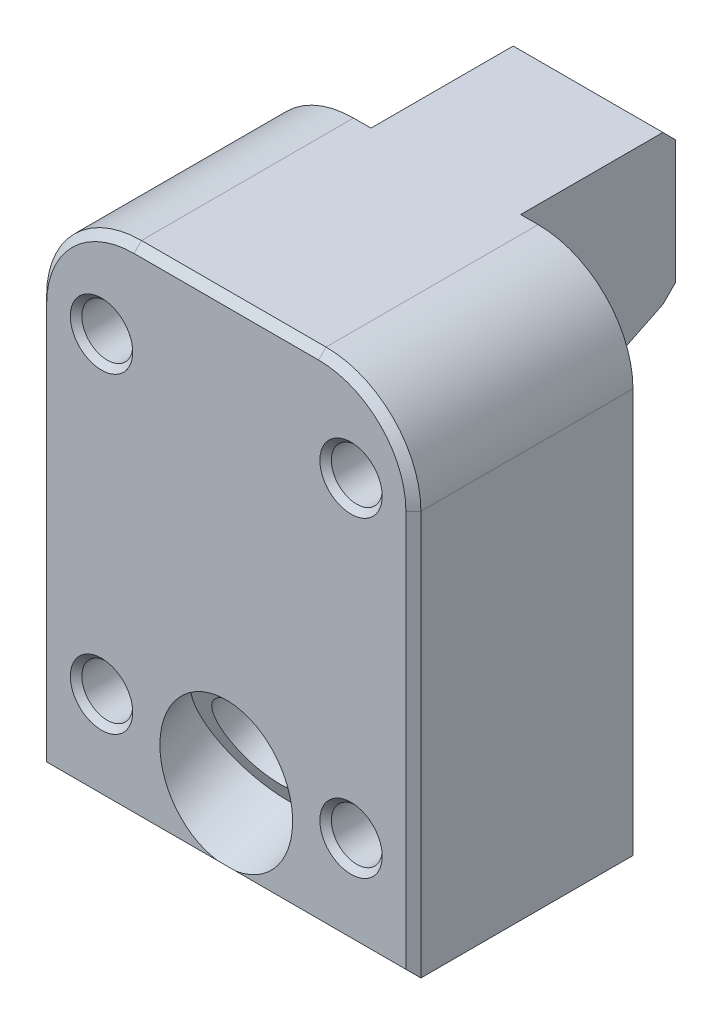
ISO-10303-21;
HEADER;
FILE_DESCRIPTION(('STEP AP214'),'2;1');
FILE_NAME('part.step','',(''),(''),'','','');
FILE_SCHEMA(('AUTOMOTIVE_DESIGN { 1 0 10303 214 1 1 1 1 }'));
ENDSEC;
DATA;
#1=APPLICATION_CONTEXT('core data for automotive mechanical design processes');
#2=APPLICATION_PROTOCOL_DEFINITION('international standard','automotive_design',2000,#1);
#3=PRODUCT_CONTEXT('',#1,'mechanical');
#4=PRODUCT('Part','Part','',(#3));
#5=PRODUCT_RELATED_PRODUCT_CATEGORY('part','',(#4));
#6=PRODUCT_DEFINITION_FORMATION('','',#4);
#7=PRODUCT_DEFINITION_CONTEXT('part definition',#1,'design');
#8=PRODUCT_DEFINITION('design','',#6,#7);
#9=PRODUCT_DEFINITION_SHAPE('','',#8);
#10=(LENGTH_UNIT() NAMED_UNIT(*) SI_UNIT(.MILLI.,.METRE.));
#11=(NAMED_UNIT(*) PLANE_ANGLE_UNIT() SI_UNIT($,.RADIAN.));
#12=(NAMED_UNIT(*) SI_UNIT($,.STERADIAN.) SOLID_ANGLE_UNIT());
#13=UNCERTAINTY_MEASURE_WITH_UNIT(LENGTH_MEASURE(1.E-05),#10,'distance_accuracy_value','');
#14=(GEOMETRIC_REPRESENTATION_CONTEXT(3) GLOBAL_UNCERTAINTY_ASSIGNED_CONTEXT((#13)) GLOBAL_UNIT_ASSIGNED_CONTEXT((#10,
#11,#12)) REPRESENTATION_CONTEXT('',''));
#15=CARTESIAN_POINT('',(0.,0.,0.));
#16=DIRECTION('',(0.,0.,1.));
#17=DIRECTION('',(1.,0.,0.));
#18=AXIS2_PLACEMENT_3D('',#15,#16,#17);
#19=CARTESIAN_POINT('',(0.,50.8,22.352));
#20=DIRECTION('',(0.,0.,-1.));
#21=DIRECTION('',(-1.,0.,0.));
#22=AXIS2_PLACEMENT_3D('',#19,#20,#21);
#23=PLANE('',#22);
#24=DIRECTION('',(0.999999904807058,-0.000436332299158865,0.));
#25=VECTOR('',#24,1.);
#26=CARTESIAN_POINT('',(-9.52500030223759,41.2736146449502,22.352));
#27=LINE('',#26,#25);
#28=CARTESIAN_POINT('',(-9.52474630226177,41.2736145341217,22.352));
#29=VERTEX_POINT('',#28);
#30=CARTESIAN_POINT('',(-9.52500030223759,41.2736146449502,22.352));
#31=VERTEX_POINT('',#30);
#32=EDGE_CURVE('E1425',#29,#31,#27,.F.);
#33=ORIENTED_EDGE('',*,*,#32,.F.);
#34=CARTESIAN_POINT('',(-12.7,41.275,22.352));
#35=DIRECTION('',(0.,0.,1.));
#36=DIRECTION('',(1.,0.,0.));
#37=AXIS2_PLACEMENT_3D('',#34,#35,#36);
#38=CIRCLE('',#37,3.175254);
#39=CARTESIAN_POINT('',(-9.524746,41.275,22.352));
#40=VERTEX_POINT('',#39);
#41=EDGE_CURVE('E1376',#40,#29,#38,.T.);
#42=ORIENTED_EDGE('',*,*,#41,.F.);
#43=DIRECTION('',(1.,0.,0.));
#44=VECTOR('',#43,1.);
#45=CARTESIAN_POINT('',(-9.525,41.275,22.352));
#46=LINE('',#45,#44);
#47=CARTESIAN_POINT('',(-9.525,41.275,22.352));
#48=VERTEX_POINT('',#47);
#49=EDGE_CURVE('E40',#40,#48,#46,.F.);
#50=ORIENTED_EDGE('',*,*,#49,.T.);
#51=CARTESIAN_POINT('',(-12.7,41.275,22.352));
#52=DIRECTION('',(0.,0.,-1.));
#53=DIRECTION('',(-1.,0.,0.));
#54=AXIS2_PLACEMENT_3D('',#51,#52,#53);
#55=CIRCLE('',#54,3.175);
#56=EDGE_CURVE('E376',#48,#31,#55,.T.);
#57=ORIENTED_EDGE('',*,*,#56,.T.);
#58=EDGE_LOOP('',(#33,#42,#50,#57));
#59=FACE_BOUND('',#58,.T.);
#60=DIRECTION('',(0.999999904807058,-0.000436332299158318,0.));
#61=VECTOR('',#60,1.);
#62=CARTESIAN_POINT('',(15.8749996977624,9.52361464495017,22.352));
#63=LINE('',#62,#61);
#64=CARTESIAN_POINT('',(15.8752536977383,9.52361453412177,22.352));
#65=VERTEX_POINT('',#64);
#66=CARTESIAN_POINT('',(15.8749996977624,9.52361464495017,22.352));
#67=VERTEX_POINT('',#66);
#68=EDGE_CURVE('E411',#65,#67,#63,.F.);
#69=ORIENTED_EDGE('',*,*,#68,.F.);
#70=CARTESIAN_POINT('',(12.7,9.525,22.352));
#71=DIRECTION('',(0.,0.,1.));
#72=DIRECTION('',(1.,0.,0.));
#73=AXIS2_PLACEMENT_3D('',#70,#71,#72);
#74=CIRCLE('',#73,3.175254);
#75=CARTESIAN_POINT('',(15.875254,9.525,22.352));
#76=VERTEX_POINT('',#75);
#77=EDGE_CURVE('E1532',#76,#65,#74,.T.);
#78=ORIENTED_EDGE('',*,*,#77,.F.);
#79=DIRECTION('',(1.,0.,0.));
#80=VECTOR('',#79,1.);
#81=CARTESIAN_POINT('',(15.875,9.525,22.352));
#82=LINE('',#81,#80);
#83=CARTESIAN_POINT('',(15.875,9.525,22.352));
#84=VERTEX_POINT('',#83);
#85=EDGE_CURVE('E414',#76,#84,#82,.F.);
#86=ORIENTED_EDGE('',*,*,#85,.T.);
#87=CARTESIAN_POINT('',(12.7,9.525,22.352));
#88=DIRECTION('',(0.,0.,-1.));
#89=DIRECTION('',(-1.,0.,0.));
#90=AXIS2_PLACEMENT_3D('',#87,#88,#89);
#91=CIRCLE('',#90,3.175);
#92=EDGE_CURVE('E391',#84,#67,#91,.T.);
#93=ORIENTED_EDGE('',*,*,#92,.T.);
#94=EDGE_LOOP('',(#69,#78,#86,#93));
#95=FACE_BOUND('',#94,.T.);
#96=DIRECTION('',(0.,-1.,0.));
#97=VECTOR('',#96,1.);
#98=CARTESIAN_POINT('',(-18.288,0.,22.352));
#99=LINE('',#98,#97);
#100=CARTESIAN_POINT('',(-18.288,41.148,22.352));
#101=VERTEX_POINT('',#100);
#102=CARTESIAN_POINT('',(-18.288,0.762,22.352));
#103=VERTEX_POINT('',#102);
#104=EDGE_CURVE('E493',#101,#103,#99,.T.);
#105=ORIENTED_EDGE('',*,*,#104,.T.);
#106=DIRECTION('',(1.,0.,0.));
#107=VECTOR('',#106,1.);
#108=CARTESIAN_POINT('',(19.05,0.762,22.352));
#109=LINE('',#108,#107);
#110=CARTESIAN_POINT('',(-0.90825850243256,0.762,22.352));
#111=VERTEX_POINT('',#110);
#112=EDGE_CURVE('E496',#103,#111,#109,.T.);
#113=ORIENTED_EDGE('',*,*,#112,.T.);
#114=CARTESIAN_POINT('',(0.,8.03526243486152,22.352));
#115=DIRECTION('',(0.,0.,-1.));
#116=DIRECTION('',(0.,1.,0.));
#117=AXIS2_PLACEMENT_3D('',#114,#115,#116);
#118=ELLIPSE('',#117,7.33988525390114,6.7564);
#119=CARTESIAN_POINT('',(0.908258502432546,0.762,22.352));
#120=VERTEX_POINT('',#119);
#121=EDGE_CURVE('E464',#120,#111,#118,.F.);
#122=ORIENTED_EDGE('',*,*,#121,.F.);
#123=DIRECTION('',(1.,0.,0.));
#124=VECTOR('',#123,1.);
#125=CARTESIAN_POINT('',(19.05,0.762,22.352));
#126=LINE('',#125,#124);
#127=CARTESIAN_POINT('',(18.288,0.762,22.352));
#128=VERTEX_POINT('',#127);
#129=EDGE_CURVE('E483',#120,#128,#126,.T.);
#130=ORIENTED_EDGE('',*,*,#129,.T.);
#131=DIRECTION('',(0.,1.,0.));
#132=VECTOR('',#131,1.);
#133=CARTESIAN_POINT('',(18.288,50.8,22.352));
#134=LINE('',#133,#132);
#135=CARTESIAN_POINT('',(18.288,41.148,22.352));
#136=VERTEX_POINT('',#135);
#137=EDGE_CURVE('E485',#128,#136,#134,.T.);
#138=ORIENTED_EDGE('',*,*,#137,.T.);
#139=CARTESIAN_POINT('',(9.398,41.148,22.352));
#140=DIRECTION('',(0.,0.,-1.));
#141=DIRECTION('',(-1.,0.,0.));
#142=AXIS2_PLACEMENT_3D('',#139,#140,#141);
#143=CIRCLE('',#142,8.89);
#144=CARTESIAN_POINT('',(9.398,50.038,22.352));
#145=VERTEX_POINT('',#144);
#146=EDGE_CURVE('E487',#136,#145,#143,.F.);
#147=ORIENTED_EDGE('',*,*,#146,.T.);
#148=DIRECTION('',(-1.,0.,0.));
#149=VECTOR('',#148,1.);
#150=CARTESIAN_POINT('',(0.,50.038,22.352));
#151=LINE('',#150,#149);
#152=CARTESIAN_POINT('',(-9.398,50.038,22.352));
#153=VERTEX_POINT('',#152);
#154=EDGE_CURVE('E489',#145,#153,#151,.T.);
#155=ORIENTED_EDGE('',*,*,#154,.T.);
#156=CARTESIAN_POINT('',(-9.398,41.148,22.352));
#157=DIRECTION('',(0.,0.,-1.));
#158=DIRECTION('',(-1.,0.,0.));
#159=AXIS2_PLACEMENT_3D('',#156,#157,#158);
#160=CIRCLE('',#159,8.89);
#161=EDGE_CURVE('E491',#153,#101,#160,.F.);
#162=ORIENTED_EDGE('',*,*,#161,.T.);
#163=EDGE_LOOP('',(#105,#113,#122,#130,#138,#147,#155,#162));
#164=FACE_BOUND('',#163,.T.);
#165=DIRECTION('',(0.999999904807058,-0.000436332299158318,0.));
#166=VECTOR('',#165,1.);
#167=CARTESIAN_POINT('',(-9.52500030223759,9.52361464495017,22.352));
#168=LINE('',#167,#166);
#169=CARTESIAN_POINT('',(-9.52474630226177,9.52361453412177,22.352));
#170=VERTEX_POINT('',#169);
#171=CARTESIAN_POINT('',(-9.52500030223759,9.52361464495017,22.352));
#172=VERTEX_POINT('',#171);
#173=EDGE_CURVE('E1555',#170,#172,#168,.F.);
#174=ORIENTED_EDGE('',*,*,#173,.F.);
#175=CARTESIAN_POINT('',(-12.7,9.525,22.352));
#176=DIRECTION('',(0.,0.,1.));
#177=DIRECTION('',(1.,0.,0.));
#178=AXIS2_PLACEMENT_3D('',#175,#176,#177);
#179=CIRCLE('',#178,3.175254);
#180=CARTESIAN_POINT('',(-9.524746,9.525,22.352));
#181=VERTEX_POINT('',#180);
#182=EDGE_CURVE('E1500',#181,#170,#179,.T.);
#183=ORIENTED_EDGE('',*,*,#182,.F.);
#184=DIRECTION('',(1.,0.,0.));
#185=VECTOR('',#184,1.);
#186=CARTESIAN_POINT('',(-9.525,9.525,22.352));
#187=LINE('',#186,#185);
#188=CARTESIAN_POINT('',(-9.525,9.525,22.352));
#189=VERTEX_POINT('',#188);
#190=EDGE_CURVE('E1470',#181,#189,#187,.F.);
#191=ORIENTED_EDGE('',*,*,#190,.T.);
#192=CARTESIAN_POINT('',(-12.7,9.525,22.352));
#193=DIRECTION('',(0.,0.,-1.));
#194=DIRECTION('',(-1.,0.,0.));
#195=AXIS2_PLACEMENT_3D('',#192,#193,#194);
#196=CIRCLE('',#195,3.175);
#197=EDGE_CURVE('E396',#189,#172,#196,.T.);
#198=ORIENTED_EDGE('',*,*,#197,.T.);
#199=EDGE_LOOP('',(#174,#183,#191,#198));
#200=FACE_BOUND('',#199,.T.);
#201=DIRECTION('',(0.999999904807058,-0.000436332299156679,0.));
#202=VECTOR('',#201,1.);
#203=CARTESIAN_POINT('',(15.8749996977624,41.2736146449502,22.352));
#204=LINE('',#203,#202);
#205=CARTESIAN_POINT('',(15.8752536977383,41.2736145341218,22.352));
#206=VERTEX_POINT('',#205);
#207=CARTESIAN_POINT('',(15.8749996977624,41.2736146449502,22.352));
#208=VERTEX_POINT('',#207);
#209=EDGE_CURVE('E1398',#206,#208,#204,.F.);
#210=ORIENTED_EDGE('',*,*,#209,.F.);
#211=CARTESIAN_POINT('',(12.7,41.275,22.352));
#212=DIRECTION('',(0.,0.,1.));
#213=DIRECTION('',(1.,0.,0.));
#214=AXIS2_PLACEMENT_3D('',#211,#212,#213);
#215=CIRCLE('',#214,3.175254);
#216=CARTESIAN_POINT('',(15.875254,41.275,22.352));
#217=VERTEX_POINT('',#216);
#218=EDGE_CURVE('E1330',#217,#206,#215,.T.);
#219=ORIENTED_EDGE('',*,*,#218,.F.);
#220=DIRECTION('',(1.,0.,0.));
#221=VECTOR('',#220,1.);
#222=CARTESIAN_POINT('',(15.875,41.275,22.352));
#223=LINE('',#222,#221);
#224=CARTESIAN_POINT('',(15.875,41.275,22.352));
#225=VERTEX_POINT('',#224);
#226=EDGE_CURVE('E19',#217,#225,#223,.F.);
#227=ORIENTED_EDGE('',*,*,#226,.T.);
#228=CARTESIAN_POINT('',(12.7,41.275,22.352));
#229=DIRECTION('',(0.,0.,-1.));
#230=DIRECTION('',(-1.,0.,0.));
#231=AXIS2_PLACEMENT_3D('',#228,#229,#230);
#232=CIRCLE('',#231,3.175);
#233=EDGE_CURVE('E1428',#225,#208,#232,.T.);
#234=ORIENTED_EDGE('',*,*,#233,.T.);
#235=EDGE_LOOP('',(#210,#219,#227,#234));
#236=FACE_BOUND('',#235,.T.);
#237=ADVANCED_FACE('F15',(#59,#95,#164,#200,#236),#23,.F.);
#238=CARTESIAN_POINT('',(-7.62,50.8,0.));
#239=DIRECTION('',(-1.,0.,0.));
#240=DIRECTION('',(0.,0.,1.));
#241=AXIS2_PLACEMENT_3D('',#238,#239,#240);
#242=PLANE('',#241);
#243=DIRECTION('',(0.,-1.,0.));
#244=VECTOR('',#243,1.);
#245=CARTESIAN_POINT('',(-7.62,50.8,-15.748));
#246=LINE('',#245,#244);
#247=CARTESIAN_POINT('',(-7.62,49.53,-15.748));
#248=VERTEX_POINT('',#247);
#249=CARTESIAN_POINT('',(-7.62,36.9040808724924,-15.748));
#250=VERTEX_POINT('',#249);
#251=EDGE_CURVE('E517',#248,#250,#246,.T.);
#252=ORIENTED_EDGE('',*,*,#251,.T.);
#253=DIRECTION('',(0.,0.707106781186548,-0.707106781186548));
#254=VECTOR('',#253,1.);
#255=CARTESIAN_POINT('',(-7.62,35.9780404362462,-14.8219595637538));
#256=LINE('',#255,#254);
#257=CARTESIAN_POINT('',(-7.62,35.6397021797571,-14.4836213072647));
#258=VERTEX_POINT('',#257);
#259=EDGE_CURVE('E537',#250,#258,#256,.F.);
#260=ORIENTED_EDGE('',*,*,#259,.T.);
#261=DIRECTION('',(0.,0.438371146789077,-0.898794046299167));
#262=VECTOR('',#261,1.);
#263=CARTESIAN_POINT('',(-7.62,32.846420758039,-8.75654567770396));
#264=LINE('',#263,#262);
#265=CARTESIAN_POINT('',(-7.62,29.4800674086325,-1.85449847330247));
#266=VERTEX_POINT('',#265);
#267=EDGE_CURVE('E455',#266,#258,#264,.T.);
#268=ORIENTED_EDGE('',*,*,#267,.F.);
#269=CARTESIAN_POINT('',(-7.62,26.5122494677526,-3.302));
#270=DIRECTION('',(-1.,0.,0.));
#271=DIRECTION('',(0.,0.,1.));
#272=AXIS2_PLACEMENT_3D('',#269,#270,#271);
#273=CIRCLE('',#272,3.302);
#274=CARTESIAN_POINT('',(-7.62,26.5122494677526,0.));
#275=VERTEX_POINT('',#274);
#276=EDGE_CURVE('E367',#266,#275,#273,.F.);
#277=ORIENTED_EDGE('',*,*,#276,.T.);
#278=DIRECTION('',(0.,-1.,0.));
#279=VECTOR('',#278,1.);
#280=CARTESIAN_POINT('',(-7.62,50.8,0.));
#281=LINE('',#280,#279);
#282=CARTESIAN_POINT('',(-7.62,50.8,0.));
#283=VERTEX_POINT('',#282);
#284=EDGE_CURVE('E364',#283,#275,#281,.T.);
#285=ORIENTED_EDGE('',*,*,#284,.F.);
#286=DIRECTION('',(0.,0.,1.));
#287=VECTOR('',#286,1.);
#288=CARTESIAN_POINT('',(-7.62,50.8,0.));
#289=LINE('',#288,#287);
#290=CARTESIAN_POINT('',(-7.62,50.8,-14.478));
#291=VERTEX_POINT('',#290);
#292=EDGE_CURVE('E434',#291,#283,#289,.T.);
#293=ORIENTED_EDGE('',*,*,#292,.F.);
#294=DIRECTION('',(0.,0.707106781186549,0.707106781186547));
#295=VECTOR('',#294,1.);
#296=CARTESIAN_POINT('',(-7.62,58.039,-7.239));
#297=LINE('',#296,#295);
#298=EDGE_CURVE('E528',#291,#248,#297,.F.);
#299=ORIENTED_EDGE('',*,*,#298,.T.);
#300=EDGE_LOOP('',(#252,#260,#268,#277,#285,#293,#299));
#301=FACE_BOUND('',#300,.T.);
#302=ADVANCED_FACE('F306',(#301),#242,.T.);
#303=CARTESIAN_POINT('',(7.62,50.8,0.));
#304=DIRECTION('',(-1.,0.,0.));
#305=DIRECTION('',(0.,0.,1.));
#306=AXIS2_PLACEMENT_3D('',#303,#304,#305);
#307=PLANE('',#306);
#308=DIRECTION('',(0.,-1.,0.));
#309=VECTOR('',#308,1.);
#310=CARTESIAN_POINT('',(7.62,50.8,0.));
#311=LINE('',#310,#309);
#312=CARTESIAN_POINT('',(7.62,50.8,0.));
#313=VERTEX_POINT('',#312);
#314=CARTESIAN_POINT('',(7.62,26.5122494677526,0.));
#315=VERTEX_POINT('',#314);
#316=EDGE_CURVE('E348',#313,#315,#311,.T.);
#317=ORIENTED_EDGE('',*,*,#316,.T.);
#318=CARTESIAN_POINT('',(7.62,26.5122494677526,-3.302));
#319=DIRECTION('',(-1.,0.,0.));
#320=DIRECTION('',(0.,0.,1.));
#321=AXIS2_PLACEMENT_3D('',#318,#319,#320);
#322=CIRCLE('',#321,3.302);
#323=CARTESIAN_POINT('',(7.62,29.4800674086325,-1.85449847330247));
#324=VERTEX_POINT('',#323);
#325=EDGE_CURVE('E351',#315,#324,#322,.T.);
#326=ORIENTED_EDGE('',*,*,#325,.T.);
#327=DIRECTION('',(0.,0.438371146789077,-0.898794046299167));
#328=VECTOR('',#327,1.);
#329=CARTESIAN_POINT('',(7.62,32.846420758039,-8.75654567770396));
#330=LINE('',#329,#328);
#331=CARTESIAN_POINT('',(7.62,35.639702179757,-14.4836213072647));
#332=VERTEX_POINT('',#331);
#333=EDGE_CURVE('E467',#324,#332,#330,.T.);
#334=ORIENTED_EDGE('',*,*,#333,.T.);
#335=DIRECTION('',(0.,-0.707106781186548,0.707106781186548));
#336=VECTOR('',#335,1.);
#337=CARTESIAN_POINT('',(7.62,36.9040808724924,-15.748));
#338=LINE('',#337,#336);
#339=CARTESIAN_POINT('',(7.62,36.9040808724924,-15.748));
#340=VERTEX_POINT('',#339);
#341=EDGE_CURVE('E543',#332,#340,#338,.F.);
#342=ORIENTED_EDGE('',*,*,#341,.T.);
#343=DIRECTION('',(0.,-1.,0.));
#344=VECTOR('',#343,1.);
#345=CARTESIAN_POINT('',(7.62,50.8,-15.748));
#346=LINE('',#345,#344);
#347=CARTESIAN_POINT('',(7.62,49.53,-15.748));
#348=VERTEX_POINT('',#347);
#349=EDGE_CURVE('E356',#348,#340,#346,.T.);
#350=ORIENTED_EDGE('',*,*,#349,.F.);
#351=DIRECTION('',(0.,-0.707106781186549,-0.707106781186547));
#352=VECTOR('',#351,1.);
#353=CARTESIAN_POINT('',(7.62,50.8,-14.478));
#354=LINE('',#353,#352);
#355=CARTESIAN_POINT('',(7.62,50.8,-14.478));
#356=VERTEX_POINT('',#355);
#357=EDGE_CURVE('E532',#348,#356,#354,.F.);
#358=ORIENTED_EDGE('',*,*,#357,.T.);
#359=DIRECTION('',(0.,0.,1.));
#360=VECTOR('',#359,1.);
#361=CARTESIAN_POINT('',(7.62,50.8,0.));
#362=LINE('',#361,#360);
#363=EDGE_CURVE('E354',#356,#313,#362,.T.);
#364=ORIENTED_EDGE('',*,*,#363,.T.);
#365=EDGE_LOOP('',(#317,#326,#334,#342,#350,#358,#364));
#366=FACE_BOUND('',#365,.T.);
#367=ADVANCED_FACE('F312',(#366),#307,.F.);
#368=CARTESIAN_POINT('',(7.6835,50.8,-15.748));
#369=DIRECTION('',(0.,0.,1.));
#370=DIRECTION('',(1.,0.,0.));
#371=AXIS2_PLACEMENT_3D('',#368,#369,#370);
#372=PLANE('',#371);
#373=ORIENTED_EDGE('',*,*,#349,.T.);
#374=DIRECTION('',(-1.,0.,0.));
#375=VECTOR('',#374,1.);
#376=CARTESIAN_POINT('',(7.6835,36.9040808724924,-15.748));
#377=LINE('',#376,#375);
#378=EDGE_CURVE('E534',#340,#250,#377,.T.);
#379=ORIENTED_EDGE('',*,*,#378,.T.);
#380=ORIENTED_EDGE('',*,*,#251,.F.);
#381=DIRECTION('',(1.,0.,0.));
#382=VECTOR('',#381,1.);
#383=CARTESIAN_POINT('',(7.6835,49.53,-15.748));
#384=LINE('',#383,#382);
#385=EDGE_CURVE('E530',#248,#348,#384,.T.);
#386=ORIENTED_EDGE('',*,*,#385,.T.);
#387=EDGE_LOOP('',(#373,#379,#380,#386));
#388=FACE_BOUND('',#387,.T.);
#389=ADVANCED_FACE('F331',(#388),#372,.F.);
#390=CARTESIAN_POINT('',(-7.6835,50.8,22.352));
#391=DIRECTION('',(0.,-1.,0.));
#392=DIRECTION('',(0.,0.,-1.));
#393=AXIS2_PLACEMENT_3D('',#390,#391,#392);
#394=PLANE('',#393);
#395=ORIENTED_EDGE('',*,*,#363,.F.);
#396=DIRECTION('',(-1.,0.,0.));
#397=VECTOR('',#396,1.);
#398=CARTESIAN_POINT('',(-7.6835,50.8,-14.478));
#399=LINE('',#398,#397);
#400=EDGE_CURVE('E513',#356,#291,#399,.T.);
#401=ORIENTED_EDGE('',*,*,#400,.T.);
#402=ORIENTED_EDGE('',*,*,#292,.T.);
#403=DIRECTION('',(-1.,0.,0.));
#404=VECTOR('',#403,1.);
#405=CARTESIAN_POINT('',(19.05,50.8,0.));
#406=LINE('',#405,#404);
#407=CARTESIAN_POINT('',(-9.398,50.8,0.));
#408=VERTEX_POINT('',#407);
#409=EDGE_CURVE('E456',#283,#408,#406,.T.);
#410=ORIENTED_EDGE('',*,*,#409,.T.);
#411=DIRECTION('',(0.,0.,-1.));
#412=VECTOR('',#411,1.);
#413=CARTESIAN_POINT('',(-9.398,50.8,22.352));
#414=LINE('',#413,#412);
#415=CARTESIAN_POINT('',(-9.398,50.8,21.59));
#416=VERTEX_POINT('',#415);
#417=EDGE_CURVE('E461',#408,#416,#414,.F.);
#418=ORIENTED_EDGE('',*,*,#417,.T.);
#419=DIRECTION('',(1.,0.,0.));
#420=VECTOR('',#419,1.);
#421=CARTESIAN_POINT('',(-7.6835,50.8,21.59));
#422=LINE('',#421,#420);
#423=CARTESIAN_POINT('',(9.398,50.8,21.59));
#424=VERTEX_POINT('',#423);
#425=EDGE_CURVE('E503',#416,#424,#422,.T.);
#426=ORIENTED_EDGE('',*,*,#425,.T.);
#427=DIRECTION('',(0.,0.,-1.));
#428=VECTOR('',#427,1.);
#429=CARTESIAN_POINT('',(9.398,50.8,22.352));
#430=LINE('',#429,#428);
#431=CARTESIAN_POINT('',(9.398,50.8,0.));
#432=VERTEX_POINT('',#431);
#433=EDGE_CURVE('E470',#424,#432,#430,.T.);
#434=ORIENTED_EDGE('',*,*,#433,.T.);
#435=EDGE_CURVE('E449',#432,#313,#406,.T.);
#436=ORIENTED_EDGE('',*,*,#435,.T.);
#437=EDGE_LOOP('',(#395,#401,#402,#410,#418,#426,#434,#436));
#438=FACE_BOUND('',#437,.T.);
#439=ADVANCED_FACE('F319',(#438),#394,.F.);
#440=CARTESIAN_POINT('',(-7.6835,0.,22.352));
#441=DIRECTION('',(0.,-1.,0.));
#442=DIRECTION('',(0.,0.,-1.));
#443=AXIS2_PLACEMENT_3D('',#440,#441,#442);
#444=PLANE('',#443);
#445=DIRECTION('',(0.,0.,-1.));
#446=VECTOR('',#445,1.);
#447=CARTESIAN_POINT('',(19.05,0.,22.352));
#448=LINE('',#447,#446);
#449=CARTESIAN_POINT('',(19.05,0.,21.59));
#450=VERTEX_POINT('',#449);
#451=CARTESIAN_POINT('',(19.05,0.,0.));
#452=VERTEX_POINT('',#451);
#453=EDGE_CURVE('E447',#450,#452,#448,.T.);
#454=ORIENTED_EDGE('',*,*,#453,.F.);
#455=DIRECTION('',(-1.,0.,0.));
#456=VECTOR('',#455,1.);
#457=CARTESIAN_POINT('',(-19.05,0.,21.59));
#458=LINE('',#457,#456);
#459=CARTESIAN_POINT('',(-19.05,0.,21.59));
#460=VERTEX_POINT('',#459);
#461=EDGE_CURVE('E511',#450,#460,#458,.T.);
#462=ORIENTED_EDGE('',*,*,#461,.T.);
#463=DIRECTION('',(0.,0.,-1.));
#464=VECTOR('',#463,1.);
#465=CARTESIAN_POINT('',(-19.05,0.,22.352));
#466=LINE('',#465,#464);
#467=CARTESIAN_POINT('',(-19.05,0.,0.));
#468=VERTEX_POINT('',#467);
#469=EDGE_CURVE('E453',#460,#468,#466,.T.);
#470=ORIENTED_EDGE('',*,*,#469,.T.);
#471=DIRECTION('',(-1.,0.,0.));
#472=VECTOR('',#471,1.);
#473=CARTESIAN_POINT('',(19.05,0.,0.));
#474=LINE('',#473,#472);
#475=EDGE_CURVE('E450',#452,#468,#474,.T.);
#476=ORIENTED_EDGE('',*,*,#475,.F.);
#477=EDGE_LOOP('',(#454,#462,#470,#476));
#478=FACE_BOUND('',#477,.T.);
#479=ADVANCED_FACE('F337',(#478),#444,.T.);
#480=CARTESIAN_POINT('',(-19.05,50.8,22.352));
#481=DIRECTION('',(-1.,0.,0.));
#482=DIRECTION('',(0.,0.,1.));
#483=AXIS2_PLACEMENT_3D('',#480,#481,#482);
#484=PLANE('',#483);
#485=ORIENTED_EDGE('',*,*,#469,.F.);
#486=DIRECTION('',(0.,1.,0.));
#487=VECTOR('',#486,1.);
#488=CARTESIAN_POINT('',(-19.05,41.148,21.59));
#489=LINE('',#488,#487);
#490=CARTESIAN_POINT('',(-19.05,41.148,21.59));
#491=VERTEX_POINT('',#490);
#492=EDGE_CURVE('E498',#460,#491,#489,.T.);
#493=ORIENTED_EDGE('',*,*,#492,.T.);
#494=DIRECTION('',(0.,0.,-1.));
#495=VECTOR('',#494,1.);
#496=CARTESIAN_POINT('',(-19.05,41.148,0.));
#497=LINE('',#496,#495);
#498=CARTESIAN_POINT('',(-19.05,41.148,0.));
#499=VERTEX_POINT('',#498);
#500=EDGE_CURVE('E481',#491,#499,#497,.T.);
#501=ORIENTED_EDGE('',*,*,#500,.T.);
#502=DIRECTION('',(0.,-1.,0.));
#503=VECTOR('',#502,1.);
#504=CARTESIAN_POINT('',(-19.05,50.8,0.));
#505=LINE('',#504,#503);
#506=EDGE_CURVE('E458',#499,#468,#505,.T.);
#507=ORIENTED_EDGE('',*,*,#506,.T.);
#508=EDGE_LOOP('',(#485,#493,#501,#507));
#509=FACE_BOUND('',#508,.T.);
#510=ADVANCED_FACE('F329',(#509),#484,.T.);
#511=CARTESIAN_POINT('',(19.05,50.8,0.));
#512=DIRECTION('',(0.,0.,1.));
#513=DIRECTION('',(1.,0.,0.));
#514=AXIS2_PLACEMENT_3D('',#511,#512,#513);
#515=PLANE('',#514);
#516=ORIENTED_EDGE('',*,*,#284,.T.);
#517=DIRECTION('',(-1.,0.,0.));
#518=VECTOR('',#517,1.);
#519=CARTESIAN_POINT('',(7.62,26.5122494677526,0.));
#520=LINE('',#519,#518);
#521=EDGE_CURVE('E360',#275,#315,#520,.F.);
#522=ORIENTED_EDGE('',*,*,#521,.T.);
#523=ORIENTED_EDGE('',*,*,#316,.F.);
#524=ORIENTED_EDGE('',*,*,#435,.F.);
#525=CARTESIAN_POINT('',(9.398,41.148,0.));
#526=DIRECTION('',(0.,0.,1.));
#527=DIRECTION('',(1.,0.,0.));
#528=AXIS2_PLACEMENT_3D('',#525,#526,#527);
#529=CIRCLE('',#528,9.652);
#530=CARTESIAN_POINT('',(19.05,41.148,0.));
#531=VERTEX_POINT('',#530);
#532=EDGE_CURVE('E476',#432,#531,#529,.F.);
#533=ORIENTED_EDGE('',*,*,#532,.T.);
#534=DIRECTION('',(0.,-1.,0.));
#535=VECTOR('',#534,1.);
#536=CARTESIAN_POINT('',(19.05,50.8,0.));
#537=LINE('',#536,#535);
#538=EDGE_CURVE('E357',#531,#452,#537,.T.);
#539=ORIENTED_EDGE('',*,*,#538,.T.);
#540=ORIENTED_EDGE('',*,*,#475,.T.);
#541=ORIENTED_EDGE('',*,*,#506,.F.);
#542=CARTESIAN_POINT('',(-9.398,41.148,0.));
#543=DIRECTION('',(0.,0.,1.));
#544=DIRECTION('',(1.,0.,0.));
#545=AXIS2_PLACEMENT_3D('',#542,#543,#544);
#546=CIRCLE('',#545,9.652);
#547=EDGE_CURVE('E473',#499,#408,#546,.F.);
#548=ORIENTED_EDGE('',*,*,#547,.T.);
#549=ORIENTED_EDGE('',*,*,#409,.F.);
#550=EDGE_LOOP('',(#516,#522,#523,#524,#533,#539,#540,#541,#548,#549));
#551=FACE_BOUND('',#550,.T.);
#552=CARTESIAN_POINT('',(0.,17.5231235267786,0.));
#553=DIRECTION('',(0.,0.,1.));
#554=DIRECTION('',(0.,-1.,0.));
#555=AXIS2_PLACEMENT_3D('',#552,#553,#554);
#556=ELLIPSE('',#555,5.18068968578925,4.76885);
#557=CARTESIAN_POINT('',(0.,12.3424338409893,0.));
#558=VERTEX_POINT('',#557);
#559=EDGE_CURVE('E383',#558,#558,#556,.T.);
#560=ORIENTED_EDGE('',*,*,#559,.T.);
#561=EDGE_LOOP('',(#560));
#562=FACE_BOUND('',#561,.T.);
#563=ADVANCED_FACE('F325',(#551,#562),#515,.F.);
#564=CARTESIAN_POINT('',(19.05,50.8,22.352));
#565=DIRECTION('',(-1.,0.,0.));
#566=DIRECTION('',(0.,0.,1.));
#567=AXIS2_PLACEMENT_3D('',#564,#565,#566);
#568=PLANE('',#567);
#569=DIRECTION('',(0.,0.,-1.));
#570=VECTOR('',#569,1.);
#571=CARTESIAN_POINT('',(19.05,41.148,22.352));
#572=LINE('',#571,#570);
#573=CARTESIAN_POINT('',(19.05,41.148,21.59));
#574=VERTEX_POINT('',#573);
#575=EDGE_CURVE('E478',#531,#574,#572,.F.);
#576=ORIENTED_EDGE('',*,*,#575,.T.);
#577=DIRECTION('',(0.,-1.,0.));
#578=VECTOR('',#577,1.);
#579=CARTESIAN_POINT('',(19.05,50.8,21.59));
#580=LINE('',#579,#578);
#581=EDGE_CURVE('E507',#574,#450,#580,.T.);
#582=ORIENTED_EDGE('',*,*,#581,.T.);
#583=ORIENTED_EDGE('',*,*,#453,.T.);
#584=ORIENTED_EDGE('',*,*,#538,.F.);
#585=EDGE_LOOP('',(#576,#582,#583,#584));
#586=FACE_BOUND('',#585,.T.);
#587=ADVANCED_FACE('F321',(#586),#568,.F.);
#588=CARTESIAN_POINT('',(137.016361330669,28.5755680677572,0.));
#589=DIRECTION('',(0.,0.898794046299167,0.438371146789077));
#590=DIRECTION('',(0.,-0.438371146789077,0.898794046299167));
#591=AXIS2_PLACEMENT_3D('',#588,#589,#590);
#592=PLANE('',#591);
#593=ORIENTED_EDGE('',*,*,#333,.F.);
#594=DIRECTION('',(-1.,0.,0.));
#595=VECTOR('',#594,1.);
#596=CARTESIAN_POINT('',(-7.62,29.4800674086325,-1.85449847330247));
#597=LINE('',#596,#595);
#598=EDGE_CURVE('E368',#324,#266,#597,.T.);
#599=ORIENTED_EDGE('',*,*,#598,.T.);
#600=ORIENTED_EDGE('',*,*,#267,.T.);
#601=DIRECTION('',(1.,0.,0.));
#602=VECTOR('',#601,1.);
#603=CARTESIAN_POINT('',(137.016361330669,35.6397021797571,-14.4836213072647));
#604=LINE('',#603,#602);
#605=EDGE_CURVE('E540',#258,#332,#604,.T.);
#606=ORIENTED_EDGE('',*,*,#605,.T.);
#607=EDGE_LOOP('',(#593,#599,#600,#606));
#608=FACE_BOUND('',#607,.T.);
#609=ADVANCED_FACE('F324',(#608),#592,.F.);
#610=CARTESIAN_POINT('',(0.,-0.348039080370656,42.1018207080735));
#611=DIRECTION('',(0.,0.390731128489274,-0.92050485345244));
#612=DIRECTION('',(0.,0.92050485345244,0.390731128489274));
#613=AXIS2_PLACEMENT_3D('',#610,#611,#612);
#614=CYLINDRICAL_SURFACE('',#613,6.7564);
#615=CARTESIAN_POINT('',(0.,9.57774238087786,18.7181449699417));
#616=DIRECTION('',(0.,-0.390731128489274,0.920504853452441));
#617=DIRECTION('',(0.,-0.92050485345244,-0.390731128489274));
#618=AXIS2_PLACEMENT_3D('',#615,#616,#617);
#619=CIRCLE('',#618,6.7564);
#620=CARTESIAN_POINT('',(0.,3.3584433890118,16.0782091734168));
#621=VERTEX_POINT('',#620);
#622=EDGE_CURVE('E386',#621,#621,#619,.T.);
#623=ORIENTED_EDGE('',*,*,#622,.F.);
#624=EDGE_LOOP('',(#623));
#625=FACE_BOUND('',#624,.T.);
#626=ORIENTED_EDGE('',*,*,#121,.T.);
#627=CARTESIAN_POINT('',(0.,5.86792560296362,27.4579256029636));
#628=DIRECTION('',(0.,-0.707106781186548,0.707106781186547));
#629=DIRECTION('',(0.,-0.707106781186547,-0.707106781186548));
#630=AXIS2_PLACEMENT_3D('',#627,#628,#629);
#631=ELLIPSE('',#630,7.28701213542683,6.7564);
#632=EDGE_CURVE('E509',#111,#120,#631,.T.);
#633=ORIENTED_EDGE('',*,*,#632,.T.);
#634=EDGE_LOOP('',(#626,#633));
#635=FACE_BOUND('',#634,.T.);
#636=ADVANCED_FACE('F341',(#625,#635),#614,.F.);
#637=CARTESIAN_POINT('',(0.,9.57774238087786,18.7181449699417));
#638=DIRECTION('',(0.,-0.390731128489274,0.920504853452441));
#639=DIRECTION('',(0.,-0.92050485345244,-0.390731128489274));
#640=AXIS2_PLACEMENT_3D('',#637,#638,#639);
#641=PLANE('',#640);
#642=CARTESIAN_POINT('',(0.,9.57774238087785,18.7181449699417));
#643=DIRECTION('',(0.,-0.390731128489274,0.920504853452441));
#644=DIRECTION('',(0.,-0.92050485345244,-0.390731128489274));
#645=AXIS2_PLACEMENT_3D('',#642,#643,#644);
#646=CIRCLE('',#645,4.76885);
#647=CARTESIAN_POINT('',(0.,5.18799281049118,16.8548068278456));
#648=VERTEX_POINT('',#647);
#649=EDGE_CURVE('E380',#648,#648,#646,.T.);
#650=ORIENTED_EDGE('',*,*,#649,.F.);
#651=EDGE_LOOP('',(#650));
#652=FACE_BOUND('',#651,.T.);
#653=ORIENTED_EDGE('',*,*,#622,.T.);
#654=EDGE_LOOP('',(#653));
#655=FACE_BOUND('',#654,.T.);
#656=ADVANCED_FACE('F339',(#652,#655),#641,.T.);
#657=CARTESIAN_POINT('',(0.,19.5011022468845,-4.65982584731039));
#658=DIRECTION('',(0.,-0.390731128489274,0.92050485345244));
#659=DIRECTION('',(0.,-0.92050485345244,-0.390731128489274));
#660=AXIS2_PLACEMENT_3D('',#657,#658,#659);
#661=CYLINDRICAL_SURFACE('',#660,4.76885);
#662=ORIENTED_EDGE('',*,*,#649,.T.);
#663=EDGE_LOOP('',(#662));
#664=FACE_BOUND('',#663,.T.);
#665=ORIENTED_EDGE('',*,*,#559,.F.);
#666=EDGE_LOOP('',(#665));
#667=FACE_BOUND('',#666,.T.);
#668=ADVANCED_FACE('F17',(#664,#667),#661,.F.);
#669=CARTESIAN_POINT('',(-12.7,9.525,9.398));
#670=DIRECTION('',(0.,0.,1.));
#671=DIRECTION('',(1.,0.,0.));
#672=AXIS2_PLACEMENT_3D('',#669,#670,#671);
#673=CYLINDRICAL_SURFACE('',#672,2.5908);
#674=CARTESIAN_POINT('',(-12.7,9.525,21.7678));
#675=DIRECTION('',(0.,0.,-1.));
#676=DIRECTION('',(-1.,0.,0.));
#677=AXIS2_PLACEMENT_3D('',#674,#675,#676);
#678=CIRCLE('',#677,2.5908);
#679=CARTESIAN_POINT('',(-15.2908,9.525,21.7678));
#680=VERTEX_POINT('',#679);
#681=EDGE_CURVE('E388',#680,#680,#678,.F.);
#682=ORIENTED_EDGE('',*,*,#681,.T.);
#683=EDGE_LOOP('',(#682));
#684=FACE_BOUND('',#683,.T.);
#685=CARTESIAN_POINT('',(-12.7,9.525,8.128));
#686=DIRECTION('',(0.,0.,-1.));
#687=DIRECTION('',(-1.,0.,0.));
#688=AXIS2_PLACEMENT_3D('',#685,#686,#687);
#689=CIRCLE('',#688,2.5908);
#690=CARTESIAN_POINT('',(-15.2908,9.525,8.128));
#691=VERTEX_POINT('',#690);
#692=EDGE_CURVE('E1314',#691,#691,#689,.T.);
#693=ORIENTED_EDGE('',*,*,#692,.T.);
#694=EDGE_LOOP('',(#693));
#695=FACE_BOUND('',#694,.T.);
#696=ADVANCED_FACE('F644',(#684,#695),#673,.F.);
#697=CARTESIAN_POINT('',(12.7,41.275,9.398));
#698=DIRECTION('',(0.,0.,1.));
#699=DIRECTION('',(1.,0.,0.));
#700=AXIS2_PLACEMENT_3D('',#697,#698,#699);
#701=CYLINDRICAL_SURFACE('',#700,2.5908);
#702=CARTESIAN_POINT('',(12.7,41.275,21.7678));
#703=DIRECTION('',(0.,0.,-1.));
#704=DIRECTION('',(-1.,0.,0.));
#705=AXIS2_PLACEMENT_3D('',#702,#703,#704);
#706=CIRCLE('',#705,2.5908);
#707=CARTESIAN_POINT('',(10.1092,41.275,21.7678));
#708=VERTEX_POINT('',#707);
#709=EDGE_CURVE('E25',#708,#708,#706,.F.);
#710=ORIENTED_EDGE('',*,*,#709,.T.);
#711=EDGE_LOOP('',(#710));
#712=FACE_BOUND('',#711,.T.);
#713=CARTESIAN_POINT('',(12.7,41.275,8.128));
#714=DIRECTION('',(0.,0.,-1.));
#715=DIRECTION('',(-1.,0.,0.));
#716=AXIS2_PLACEMENT_3D('',#713,#714,#715);
#717=CIRCLE('',#716,2.5908);
#718=CARTESIAN_POINT('',(10.1092,41.275,8.128));
#719=VERTEX_POINT('',#718);
#720=EDGE_CURVE('E1315',#719,#719,#717,.T.);
#721=ORIENTED_EDGE('',*,*,#720,.T.);
#722=EDGE_LOOP('',(#721));
#723=FACE_BOUND('',#722,.T.);
#724=ADVANCED_FACE('F640',(#712,#723),#701,.F.);
#725=CARTESIAN_POINT('',(-12.7,41.275,9.398));
#726=DIRECTION('',(0.,0.,1.));
#727=DIRECTION('',(1.,0.,0.));
#728=AXIS2_PLACEMENT_3D('',#725,#726,#727);
#729=CYLINDRICAL_SURFACE('',#728,2.5908);
#730=CARTESIAN_POINT('',(-12.7,41.275,21.7678));
#731=DIRECTION('',(0.,0.,-1.));
#732=DIRECTION('',(-1.,0.,0.));
#733=AXIS2_PLACEMENT_3D('',#730,#731,#732);
#734=CIRCLE('',#733,2.5908);
#735=CARTESIAN_POINT('',(-15.2908,41.275,21.7678));
#736=VERTEX_POINT('',#735);
#737=EDGE_CURVE('E9',#736,#736,#734,.F.);
#738=ORIENTED_EDGE('',*,*,#737,.T.);
#739=EDGE_LOOP('',(#738));
#740=FACE_BOUND('',#739,.T.);
#741=CARTESIAN_POINT('',(-12.7,41.275,8.128));
#742=DIRECTION('',(0.,0.,-1.));
#743=DIRECTION('',(-1.,0.,0.));
#744=AXIS2_PLACEMENT_3D('',#741,#742,#743);
#745=CIRCLE('',#744,2.5908);
#746=CARTESIAN_POINT('',(-15.2908,41.275,8.128));
#747=VERTEX_POINT('',#746);
#748=EDGE_CURVE('E1312',#747,#747,#745,.T.);
#749=ORIENTED_EDGE('',*,*,#748,.T.);
#750=EDGE_LOOP('',(#749));
#751=FACE_BOUND('',#750,.T.);
#752=ADVANCED_FACE('F636',(#740,#751),#729,.F.);
#753=CARTESIAN_POINT('',(12.7,9.525,9.398));
#754=DIRECTION('',(0.,0.,1.));
#755=DIRECTION('',(1.,0.,0.));
#756=AXIS2_PLACEMENT_3D('',#753,#754,#755);
#757=CYLINDRICAL_SURFACE('',#756,2.5908);
#758=CARTESIAN_POINT('',(12.7,9.525,21.7678));
#759=DIRECTION('',(0.,0.,-1.));
#760=DIRECTION('',(-1.,0.,0.));
#761=AXIS2_PLACEMENT_3D('',#758,#759,#760);
#762=CIRCLE('',#761,2.5908);
#763=CARTESIAN_POINT('',(10.1092,9.525,21.7678));
#764=VERTEX_POINT('',#763);
#765=EDGE_CURVE('E373',#764,#764,#762,.F.);
#766=ORIENTED_EDGE('',*,*,#765,.T.);
#767=EDGE_LOOP('',(#766));
#768=FACE_BOUND('',#767,.T.);
#769=CARTESIAN_POINT('',(12.7,9.525,8.128));
#770=DIRECTION('',(0.,0.,-1.));
#771=DIRECTION('',(-1.,0.,0.));
#772=AXIS2_PLACEMENT_3D('',#769,#770,#771);
#773=CIRCLE('',#772,2.5908);
#774=CARTESIAN_POINT('',(10.1092,9.525,8.128));
#775=VERTEX_POINT('',#774);
#776=EDGE_CURVE('E1321',#775,#775,#773,.T.);
#777=ORIENTED_EDGE('',*,*,#776,.T.);
#778=EDGE_LOOP('',(#777));
#779=FACE_BOUND('',#778,.T.);
#780=ADVANCED_FACE('F633',(#768,#779),#757,.F.);
#781=CARTESIAN_POINT('',(9.398,41.148,22.352));
#782=DIRECTION('',(0.,0.,-1.));
#783=DIRECTION('',(-1.,0.,0.));
#784=AXIS2_PLACEMENT_3D('',#781,#782,#783);
#785=CYLINDRICAL_SURFACE('',#784,9.652);
#786=ORIENTED_EDGE('',*,*,#433,.F.);
#787=CARTESIAN_POINT('',(9.398,41.148,21.59));
#788=DIRECTION('',(0.,0.,-1.));
#789=DIRECTION('',(-1.,0.,0.));
#790=AXIS2_PLACEMENT_3D('',#787,#788,#789);
#791=CIRCLE('',#790,9.652);
#792=EDGE_CURVE('E505',#424,#574,#791,.T.);
#793=ORIENTED_EDGE('',*,*,#792,.T.);
#794=ORIENTED_EDGE('',*,*,#575,.F.);
#795=ORIENTED_EDGE('',*,*,#532,.F.);
#796=EDGE_LOOP('',(#786,#793,#794,#795));
#797=FACE_BOUND('',#796,.T.);
#798=ADVANCED_FACE('F569',(#797),#785,.T.);
#799=CARTESIAN_POINT('',(-9.398,41.148,22.352));
#800=DIRECTION('',(0.,0.,1.));
#801=DIRECTION('',(1.,0.,0.));
#802=AXIS2_PLACEMENT_3D('',#799,#800,#801);
#803=CYLINDRICAL_SURFACE('',#802,9.652);
#804=ORIENTED_EDGE('',*,*,#500,.F.);
#805=CARTESIAN_POINT('',(-9.398,41.148,21.59));
#806=DIRECTION('',(0.,0.,-1.));
#807=DIRECTION('',(-1.,0.,0.));
#808=AXIS2_PLACEMENT_3D('',#805,#806,#807);
#809=CIRCLE('',#808,9.652);
#810=EDGE_CURVE('E501',#491,#416,#809,.T.);
#811=ORIENTED_EDGE('',*,*,#810,.T.);
#812=ORIENTED_EDGE('',*,*,#417,.F.);
#813=ORIENTED_EDGE('',*,*,#547,.F.);
#814=EDGE_LOOP('',(#804,#811,#812,#813));
#815=FACE_BOUND('',#814,.T.);
#816=ADVANCED_FACE('F598',(#815),#803,.T.);
#817=CARTESIAN_POINT('',(9.398,41.148,22.352));
#818=DIRECTION('',(0.,0.,-1.));
#819=DIRECTION('',(-1.,0.,0.));
#820=AXIS2_PLACEMENT_3D('',#817,#818,#819);
#821=CONICAL_SURFACE('',#820,8.89,0.785398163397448);
#822=DIRECTION('',(-0.707106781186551,0.,0.707106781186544));
#823=VECTOR('',#822,1.);
#824=CARTESIAN_POINT('',(19.05,41.148,21.59));
#825=LINE('',#824,#823);
#826=EDGE_CURVE('E442',#574,#136,#825,.T.);
#827=ORIENTED_EDGE('',*,*,#826,.F.);
#828=ORIENTED_EDGE('',*,*,#792,.F.);
#829=DIRECTION('',(0.,0.707106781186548,-0.707106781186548));
#830=VECTOR('',#829,1.);
#831=CARTESIAN_POINT('',(9.398,50.038,22.352));
#832=LINE('',#831,#830);
#833=EDGE_CURVE('E384',#145,#424,#832,.T.);
#834=ORIENTED_EDGE('',*,*,#833,.F.);
#835=ORIENTED_EDGE('',*,*,#146,.F.);
#836=EDGE_LOOP('',(#827,#828,#834,#835));
#837=FACE_BOUND('',#836,.T.);
#838=ADVANCED_FACE('F573',(#837),#821,.T.);
#839=CARTESIAN_POINT('',(-7.6835,50.8,21.59));
#840=DIRECTION('',(0.,-0.707106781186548,-0.707106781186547));
#841=DIRECTION('',(0.,0.707106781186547,-0.707106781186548));
#842=AXIS2_PLACEMENT_3D('',#839,#840,#841);
#843=PLANE('',#842);
#844=ORIENTED_EDGE('',*,*,#833,.T.);
#845=ORIENTED_EDGE('',*,*,#425,.F.);
#846=DIRECTION('',(0.,0.707106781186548,-0.707106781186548));
#847=VECTOR('',#846,1.);
#848=CARTESIAN_POINT('',(-9.398,50.038,22.352));
#849=LINE('',#848,#847);
#850=EDGE_CURVE('E439',#153,#416,#849,.T.);
#851=ORIENTED_EDGE('',*,*,#850,.F.);
#852=ORIENTED_EDGE('',*,*,#154,.F.);
#853=EDGE_LOOP('',(#844,#845,#851,#852));
#854=FACE_BOUND('',#853,.T.);
#855=ADVANCED_FACE('F579',(#854),#843,.F.);
#856=CARTESIAN_POINT('',(19.05,50.8,21.59));
#857=DIRECTION('',(-0.707106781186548,0.,-0.707106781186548));
#858=DIRECTION('',(-0.707106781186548,0.,0.707106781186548));
#859=AXIS2_PLACEMENT_3D('',#856,#857,#858);
#860=PLANE('',#859);
#861=ORIENTED_EDGE('',*,*,#826,.T.);
#862=ORIENTED_EDGE('',*,*,#137,.F.);
#863=DIRECTION('',(0.577350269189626,-0.577350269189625,-0.577350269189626));
#864=VECTOR('',#863,1.);
#865=CARTESIAN_POINT('',(12.192,6.858,28.448));
#866=LINE('',#865,#864);
#867=EDGE_CURVE('E436',#450,#128,#866,.F.);
#868=ORIENTED_EDGE('',*,*,#867,.F.);
#869=ORIENTED_EDGE('',*,*,#581,.F.);
#870=EDGE_LOOP('',(#861,#862,#868,#869));
#871=FACE_BOUND('',#870,.T.);
#872=ADVANCED_FACE('F587',(#871),#860,.F.);
#873=CARTESIAN_POINT('',(-9.398,41.148,22.352));
#874=DIRECTION('',(0.,0.,-1.));
#875=DIRECTION('',(-1.,0.,0.));
#876=AXIS2_PLACEMENT_3D('',#873,#874,#875);
#877=CONICAL_SURFACE('',#876,8.89,0.785398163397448);
#878=ORIENTED_EDGE('',*,*,#850,.T.);
#879=ORIENTED_EDGE('',*,*,#810,.F.);
#880=DIRECTION('',(-0.707106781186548,0.,-0.707106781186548));
#881=VECTOR('',#880,1.);
#882=CARTESIAN_POINT('',(-18.288,41.148,22.352));
#883=LINE('',#882,#881);
#884=EDGE_CURVE('E433',#101,#491,#883,.T.);
#885=ORIENTED_EDGE('',*,*,#884,.F.);
#886=ORIENTED_EDGE('',*,*,#161,.F.);
#887=EDGE_LOOP('',(#878,#879,#885,#886));
#888=FACE_BOUND('',#887,.T.);
#889=ADVANCED_FACE('F601',(#888),#877,.T.);
#890=CARTESIAN_POINT('',(0.,0.762,22.352));
#891=DIRECTION('',(0.,-0.707106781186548,0.707106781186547));
#892=DIRECTION('',(0.,-0.707106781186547,-0.707106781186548));
#893=AXIS2_PLACEMENT_3D('',#890,#891,#892);
#894=PLANE('',#893);
#895=ORIENTED_EDGE('',*,*,#632,.F.);
#896=ORIENTED_EDGE('',*,*,#112,.F.);
#897=DIRECTION('',(-0.577350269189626,-0.577350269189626,-0.577350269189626));
#898=VECTOR('',#897,1.);
#899=CARTESIAN_POINT('',(-12.192,6.858,28.448));
#900=LINE('',#899,#898);
#901=EDGE_CURVE('E431',#460,#103,#900,.F.);
#902=ORIENTED_EDGE('',*,*,#901,.F.);
#903=ORIENTED_EDGE('',*,*,#461,.F.);
#904=ORIENTED_EDGE('',*,*,#867,.T.);
#905=ORIENTED_EDGE('',*,*,#129,.F.);
#906=EDGE_LOOP('',(#895,#896,#902,#903,#904,#905));
#907=FACE_BOUND('',#906,.T.);
#908=ADVANCED_FACE('F612',(#907),#894,.T.);
#909=CARTESIAN_POINT('',(-18.288,50.8,22.352));
#910=DIRECTION('',(-0.707106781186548,0.,0.707106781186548));
#911=DIRECTION('',(0.707106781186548,0.,0.707106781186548));
#912=AXIS2_PLACEMENT_3D('',#909,#910,#911);
#913=PLANE('',#912);
#914=ORIENTED_EDGE('',*,*,#884,.T.);
#915=ORIENTED_EDGE('',*,*,#492,.F.);
#916=ORIENTED_EDGE('',*,*,#901,.T.);
#917=ORIENTED_EDGE('',*,*,#104,.F.);
#918=EDGE_LOOP('',(#914,#915,#916,#917));
#919=FACE_BOUND('',#918,.T.);
#920=ADVANCED_FACE('F604',(#919),#913,.T.);
#921=CARTESIAN_POINT('',(-7.6835,50.8,-14.478));
#922=DIRECTION('',(0.,-0.707106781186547,0.707106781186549));
#923=DIRECTION('',(0.,-0.707106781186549,-0.707106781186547));
#924=AXIS2_PLACEMENT_3D('',#921,#922,#923);
#925=PLANE('',#924);
#926=ORIENTED_EDGE('',*,*,#357,.F.);
#927=ORIENTED_EDGE('',*,*,#385,.F.);
#928=ORIENTED_EDGE('',*,*,#298,.F.);
#929=ORIENTED_EDGE('',*,*,#400,.F.);
#930=EDGE_LOOP('',(#926,#927,#928,#929));
#931=FACE_BOUND('',#930,.T.);
#932=ADVANCED_FACE('F557',(#931),#925,.F.);
#933=CARTESIAN_POINT('',(7.6835,36.9040808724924,-15.748));
#934=DIRECTION('',(0.,0.707106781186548,0.707106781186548));
#935=DIRECTION('',(0.,-0.707106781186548,0.707106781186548));
#936=AXIS2_PLACEMENT_3D('',#933,#934,#935);
#937=PLANE('',#936);
#938=ORIENTED_EDGE('',*,*,#341,.F.);
#939=ORIENTED_EDGE('',*,*,#605,.F.);
#940=ORIENTED_EDGE('',*,*,#259,.F.);
#941=ORIENTED_EDGE('',*,*,#378,.F.);
#942=EDGE_LOOP('',(#938,#939,#940,#941));
#943=FACE_BOUND('',#942,.T.);
#944=ADVANCED_FACE('F552',(#943),#937,.F.);
#945=CARTESIAN_POINT('',(137.016361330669,26.5122494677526,-3.302));
#946=DIRECTION('',(1.,0.,0.));
#947=DIRECTION('',(0.,0.,-1.));
#948=AXIS2_PLACEMENT_3D('',#945,#946,#947);
#949=CYLINDRICAL_SURFACE('',#948,3.302);
#950=ORIENTED_EDGE('',*,*,#325,.F.);
#951=ORIENTED_EDGE('',*,*,#521,.F.);
#952=ORIENTED_EDGE('',*,*,#276,.F.);
#953=ORIENTED_EDGE('',*,*,#598,.F.);
#954=EDGE_LOOP('',(#950,#951,#952,#953));
#955=FACE_BOUND('',#954,.T.);
#956=ADVANCED_FACE('F371',(#955),#949,.F.);
#957=CARTESIAN_POINT('',(12.7,9.525,21.7678));
#958=DIRECTION('',(0.,0.,1.));
#959=DIRECTION('',(1.,0.,0.));
#960=AXIS2_PLACEMENT_3D('',#957,#958,#959);
#961=CONICAL_SURFACE('',#960,2.5908,0.785398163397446);
#962=ORIENTED_EDGE('',*,*,#92,.F.);
#963=CARTESIAN_POINT('',(12.7,9.525,22.352));
#964=DIRECTION('',(0.,0.,1.));
#965=DIRECTION('',(1.,0.,0.));
#966=AXIS2_PLACEMENT_3D('',#963,#964,#965);
#967=CIRCLE('',#966,3.175);
#968=EDGE_CURVE('E402',#84,#67,#967,.T.);
#969=ORIENTED_EDGE('',*,*,#968,.T.);
#970=EDGE_LOOP('',(#962,#969));
#971=FACE_BOUND('',#970,.T.);
#972=ORIENTED_EDGE('',*,*,#765,.F.);
#973=EDGE_LOOP('',(#972));
#974=FACE_BOUND('',#973,.T.);
#975=ADVANCED_FACE('F843',(#971,#974),#961,.F.);
#976=CARTESIAN_POINT('',(-12.7,9.525,21.7678));
#977=DIRECTION('',(0.,0.,1.));
#978=DIRECTION('',(1.,0.,0.));
#979=AXIS2_PLACEMENT_3D('',#976,#977,#978);
#980=CONICAL_SURFACE('',#979,2.5908,0.785398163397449);
#981=ORIENTED_EDGE('',*,*,#197,.F.);
#982=CARTESIAN_POINT('',(-12.7,9.525,22.352));
#983=DIRECTION('',(0.,0.,1.));
#984=DIRECTION('',(1.,0.,0.));
#985=AXIS2_PLACEMENT_3D('',#982,#983,#984);
#986=CIRCLE('',#985,3.175);
#987=EDGE_CURVE('E1597',#189,#172,#986,.T.);
#988=ORIENTED_EDGE('',*,*,#987,.T.);
#989=EDGE_LOOP('',(#981,#988));
#990=FACE_BOUND('',#989,.T.);
#991=ORIENTED_EDGE('',*,*,#681,.F.);
#992=EDGE_LOOP('',(#991));
#993=FACE_BOUND('',#992,.T.);
#994=ADVANCED_FACE('F852',(#990,#993),#980,.F.);
#995=CARTESIAN_POINT('',(12.7,41.275,21.7678));
#996=DIRECTION('',(0.,0.,1.));
#997=DIRECTION('',(1.,0.,0.));
#998=AXIS2_PLACEMENT_3D('',#995,#996,#997);
#999=CONICAL_SURFACE('',#998,2.5908,0.785398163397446);
#1000=ORIENTED_EDGE('',*,*,#233,.F.);
#1001=CARTESIAN_POINT('',(12.7,41.275,22.352));
#1002=DIRECTION('',(0.,0.,1.));
#1003=DIRECTION('',(1.,0.,0.));
#1004=AXIS2_PLACEMENT_3D('',#1001,#1002,#1003);
#1005=CIRCLE('',#1004,3.175);
#1006=EDGE_CURVE('E1435',#225,#208,#1005,.T.);
#1007=ORIENTED_EDGE('',*,*,#1006,.T.);
#1008=EDGE_LOOP('',(#1000,#1007));
#1009=FACE_BOUND('',#1008,.T.);
#1010=ORIENTED_EDGE('',*,*,#709,.F.);
#1011=EDGE_LOOP('',(#1010));
#1012=FACE_BOUND('',#1011,.T.);
#1013=ADVANCED_FACE('F862',(#1009,#1012),#999,.F.);
#1014=CARTESIAN_POINT('',(-12.7,41.275,21.7678));
#1015=DIRECTION('',(0.,0.,1.));
#1016=DIRECTION('',(1.,0.,0.));
#1017=AXIS2_PLACEMENT_3D('',#1014,#1015,#1016);
#1018=CONICAL_SURFACE('',#1017,2.5908,0.785398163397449);
#1019=ORIENTED_EDGE('',*,*,#56,.F.);
#1020=CARTESIAN_POINT('',(-12.7,41.275,22.352));
#1021=DIRECTION('',(0.,0.,1.));
#1022=DIRECTION('',(1.,0.,0.));
#1023=AXIS2_PLACEMENT_3D('',#1020,#1021,#1022);
#1024=CIRCLE('',#1023,3.175);
#1025=EDGE_CURVE('E1477',#48,#31,#1024,.T.);
#1026=ORIENTED_EDGE('',*,*,#1025,.T.);
#1027=EDGE_LOOP('',(#1019,#1026));
#1028=FACE_BOUND('',#1027,.T.);
#1029=ORIENTED_EDGE('',*,*,#737,.F.);
#1030=EDGE_LOOP('',(#1029));
#1031=FACE_BOUND('',#1030,.T.);
#1032=ADVANCED_FACE('F872',(#1028,#1031),#1018,.F.);
#1033=CARTESIAN_POINT('',(15.875,9.525,9.398));
#1034=DIRECTION('',(0.,-1.,0.));
#1035=DIRECTION('',(-0.5,0.,-0.866025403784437));
#1036=AXIS2_PLACEMENT_3D('',#1033,#1034,#1035);
#1037=PLANE('',#1036);
#1038=DIRECTION('',(0.5,0.,0.866025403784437));
#1039=VECTOR('',#1038,1.);
#1040=CARTESIAN_POINT('',(15.8752199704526,9.525,9.397873));
#1041=LINE('',#1040,#1039);
#1042=CARTESIAN_POINT('',(15.875254,9.525,9.398));
#1043=VERTEX_POINT('',#1042);
#1044=CARTESIAN_POINT('',(15.3037199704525,9.525,8.40800596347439));
#1045=VERTEX_POINT('',#1044);
#1046=EDGE_CURVE('E1531',#1043,#1045,#1041,.F.);
#1047=ORIENTED_EDGE('',*,*,#1046,.T.);
#1048=DIRECTION('',(0.866025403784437,0.,-0.5));
#1049=VECTOR('',#1048,1.);
#1050=CARTESIAN_POINT('',(15.3035,9.525,8.40813296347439));
#1051=LINE('',#1050,#1049);
#1052=CARTESIAN_POINT('',(15.3035,9.525,8.40813296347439));
#1053=VERTEX_POINT('',#1052);
#1054=EDGE_CURVE('E425',#1045,#1053,#1051,.F.);
#1055=ORIENTED_EDGE('',*,*,#1054,.T.);
#1056=DIRECTION('',(-0.5,0.,-0.866025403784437));
#1057=VECTOR('',#1056,1.);
#1058=CARTESIAN_POINT('',(15.875,9.525,9.398));
#1059=LINE('',#1058,#1057);
#1060=CARTESIAN_POINT('',(15.875,9.525,9.398));
#1061=VERTEX_POINT('',#1060);
#1062=EDGE_CURVE('E1560',#1061,#1053,#1059,.T.);
#1063=ORIENTED_EDGE('',*,*,#1062,.F.);
#1064=DIRECTION('',(0.,0.,-1.));
#1065=VECTOR('',#1064,1.);
#1066=CARTESIAN_POINT('',(15.875,9.525,22.352));
#1067=LINE('',#1066,#1065);
#1068=EDGE_CURVE('E408',#84,#1061,#1067,.T.);
#1069=ORIENTED_EDGE('',*,*,#1068,.F.);
#1070=ORIENTED_EDGE('',*,*,#85,.F.);
#1071=DIRECTION('',(0.,0.,1.));
#1072=VECTOR('',#1071,1.);
#1073=CARTESIAN_POINT('',(15.875254,9.525,22.352));
#1074=LINE('',#1073,#1072);
#1075=EDGE_CURVE('E1535',#76,#1043,#1074,.F.);
#1076=ORIENTED_EDGE('',*,*,#1075,.T.);
#1077=EDGE_LOOP('',(#1047,#1055,#1063,#1069,#1070,#1076));
#1078=FACE_BOUND('',#1077,.T.);
#1079=ADVANCED_FACE('F882',(#1078),#1037,.F.);
#1080=CARTESIAN_POINT('',(12.7,9.525,8.40813296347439));
#1081=DIRECTION('',(0.,0.,-1.));
#1082=DIRECTION('',(-1.,0.,0.));
#1083=AXIS2_PLACEMENT_3D('',#1080,#1081,#1082);
#1084=CONICAL_SURFACE('',#1083,2.6035,1.0471975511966);
#1085=ORIENTED_EDGE('',*,*,#1054,.F.);
#1086=CARTESIAN_POINT('',(12.7,9.525,8.40800596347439));
#1087=DIRECTION('',(0.,0.,1.));
#1088=DIRECTION('',(1.,0.,0.));
#1089=AXIS2_PLACEMENT_3D('',#1086,#1087,#1088);
#1090=CIRCLE('',#1089,2.60371997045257);
#1091=CARTESIAN_POINT('',(15.3037197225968,9.52386391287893,8.40800596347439));
#1092=VERTEX_POINT('',#1091);
#1093=EDGE_CURVE('E403',#1045,#1092,#1090,.T.);
#1094=ORIENTED_EDGE('',*,*,#1093,.T.);
#1095=DIRECTION('',(0.866025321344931,-0.000377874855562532,-0.5));
#1096=VECTOR('',#1095,1.);
#1097=CARTESIAN_POINT('',(15.3034997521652,9.52386400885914,8.40813296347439));
#1098=LINE('',#1097,#1096);
#1099=CARTESIAN_POINT('',(15.3034997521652,9.52386400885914,8.40813296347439));
#1100=VERTEX_POINT('',#1099);
#1101=EDGE_CURVE('E1566',#1092,#1100,#1098,.F.);
#1102=ORIENTED_EDGE('',*,*,#1101,.T.);
#1103=CARTESIAN_POINT('',(12.7,9.525,8.40813296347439));
#1104=DIRECTION('',(0.,0.,1.));
#1105=DIRECTION('',(1.,0.,0.));
#1106=AXIS2_PLACEMENT_3D('',#1103,#1104,#1105);
#1107=CIRCLE('',#1106,2.6035);
#1108=EDGE_CURVE('E1563',#1053,#1100,#1107,.T.);
#1109=ORIENTED_EDGE('',*,*,#1108,.F.);
#1110=EDGE_LOOP('',(#1085,#1094,#1102,#1109));
#1111=FACE_BOUND('',#1110,.T.);
#1112=ADVANCED_FACE('F892',(#1111),#1084,.T.);
#1113=CARTESIAN_POINT('',(15.8749996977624,9.52361464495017,15.875));
#1114=DIRECTION('',(-0.000436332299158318,-0.999999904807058,0.));
#1115=DIRECTION('',(0.,0.,-1.));
#1116=AXIS2_PLACEMENT_3D('',#1113,#1114,#1115);
#1117=PLANE('',#1116);
#1118=DIRECTION('',(0.,0.,1.));
#1119=VECTOR('',#1118,1.);
#1120=CARTESIAN_POINT('',(15.8752536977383,9.52361453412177,22.352));
#1121=LINE('',#1120,#1119);
#1122=CARTESIAN_POINT('',(15.8752536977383,9.52361453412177,9.398));
#1123=VERTEX_POINT('',#1122);
#1124=EDGE_CURVE('E1536',#65,#1123,#1121,.F.);
#1125=ORIENTED_EDGE('',*,*,#1124,.F.);
#1126=ORIENTED_EDGE('',*,*,#68,.T.);
#1127=DIRECTION('',(0.,0.,-1.));
#1128=VECTOR('',#1127,1.);
#1129=CARTESIAN_POINT('',(15.8749996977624,9.52361464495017,22.352));
#1130=LINE('',#1129,#1128);
#1131=CARTESIAN_POINT('',(15.8749996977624,9.52361464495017,9.398));
#1132=VERTEX_POINT('',#1131);
#1133=EDGE_CURVE('E399',#67,#1132,#1130,.T.);
#1134=ORIENTED_EDGE('',*,*,#1133,.T.);
#1135=DIRECTION('',(-0.499999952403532,0.000218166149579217,-0.866025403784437));
#1136=VECTOR('',#1135,1.);
#1137=CARTESIAN_POINT('',(15.8749996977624,9.52361464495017,9.398));
#1138=LINE('',#1137,#1136);
#1139=EDGE_CURVE('E1558',#1132,#1100,#1138,.T.);
#1140=ORIENTED_EDGE('',*,*,#1139,.T.);
#1141=ORIENTED_EDGE('',*,*,#1101,.F.);
#1142=DIRECTION('',(0.499999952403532,-0.000218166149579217,0.866025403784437));
#1143=VECTOR('',#1142,1.);
#1144=CARTESIAN_POINT('',(15.875219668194,9.52361454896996,9.397873));
#1145=LINE('',#1144,#1143);
#1146=EDGE_CURVE('E1539',#1123,#1092,#1145,.F.);
#1147=ORIENTED_EDGE('',*,*,#1146,.F.);
#1148=EDGE_LOOP('',(#1125,#1126,#1134,#1140,#1141,#1147));
#1149=FACE_BOUND('',#1148,.T.);
#1150=ADVANCED_FACE('F902',(#1149),#1117,.T.);
#1151=CARTESIAN_POINT('',(12.7,9.525,9.398));
#1152=DIRECTION('',(0.,0.,1.));
#1153=DIRECTION('',(1.,0.,0.));
#1154=AXIS2_PLACEMENT_3D('',#1151,#1152,#1153);
#1155=CONICAL_SURFACE('',#1154,3.175,0.5235987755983);
#1156=ORIENTED_EDGE('',*,*,#1139,.F.);
#1157=CARTESIAN_POINT('',(12.7,9.525,9.398));
#1158=DIRECTION('',(0.,0.,1.));
#1159=DIRECTION('',(1.,0.,0.));
#1160=AXIS2_PLACEMENT_3D('',#1157,#1158,#1159);
#1161=CIRCLE('',#1160,3.175);
#1162=EDGE_CURVE('E419',#1061,#1132,#1161,.T.);
#1163=ORIENTED_EDGE('',*,*,#1162,.F.);
#1164=ORIENTED_EDGE('',*,*,#1062,.T.);
#1165=ORIENTED_EDGE('',*,*,#1108,.T.);
#1166=EDGE_LOOP('',(#1156,#1163,#1164,#1165));
#1167=FACE_BOUND('',#1166,.T.);
#1168=ADVANCED_FACE('F912',(#1167),#1155,.T.);
#1169=CARTESIAN_POINT('',(12.7,9.525,22.352));
#1170=DIRECTION('',(0.,0.,1.));
#1171=DIRECTION('',(1.,0.,0.));
#1172=AXIS2_PLACEMENT_3D('',#1169,#1170,#1171);
#1173=CYLINDRICAL_SURFACE('',#1172,3.175);
#1174=ORIENTED_EDGE('',*,*,#1133,.F.);
#1175=ORIENTED_EDGE('',*,*,#968,.F.);
#1176=ORIENTED_EDGE('',*,*,#1068,.T.);
#1177=ORIENTED_EDGE('',*,*,#1162,.T.);
#1178=EDGE_LOOP('',(#1174,#1175,#1176,#1177));
#1179=FACE_BOUND('',#1178,.T.);
#1180=ADVANCED_FACE('F922',(#1179),#1173,.T.);
#1181=CARTESIAN_POINT('',(12.7,9.525,9.397873));
#1182=DIRECTION('',(0.,0.,1.));
#1183=DIRECTION('',(1.,0.,0.));
#1184=AXIS2_PLACEMENT_3D('',#1181,#1182,#1183);
#1185=CONICAL_SURFACE('',#1184,3.17521997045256,0.5235987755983);
#1186=ORIENTED_EDGE('',*,*,#1146,.T.);
#1187=ORIENTED_EDGE('',*,*,#1093,.F.);
#1188=ORIENTED_EDGE('',*,*,#1046,.F.);
#1189=CARTESIAN_POINT('',(12.7,9.525,9.39793194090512));
#1190=DIRECTION('',(0.,0.,1.));
#1191=DIRECTION('',(1.,0.,0.));
#1192=AXIS2_PLACEMENT_3D('',#1189,#1190,#1191);
#1193=CIRCLE('',#1192,3.175254);
#1194=EDGE_CURVE('E1537',#1043,#1123,#1193,.T.);
#1195=ORIENTED_EDGE('',*,*,#1194,.T.);
#1196=EDGE_LOOP('',(#1186,#1187,#1188,#1195));
#1197=FACE_BOUND('',#1196,.T.);
#1198=ADVANCED_FACE('F932',(#1197),#1185,.F.);
#1199=CARTESIAN_POINT('',(12.7,9.525,22.352));
#1200=DIRECTION('',(0.,0.,1.));
#1201=DIRECTION('',(1.,0.,0.));
#1202=AXIS2_PLACEMENT_3D('',#1199,#1200,#1201);
#1203=CYLINDRICAL_SURFACE('',#1202,3.175254);
#1204=ORIENTED_EDGE('',*,*,#1124,.T.);
#1205=ORIENTED_EDGE('',*,*,#1194,.F.);
#1206=ORIENTED_EDGE('',*,*,#1075,.F.);
#1207=ORIENTED_EDGE('',*,*,#77,.T.);
#1208=EDGE_LOOP('',(#1204,#1205,#1206,#1207));
#1209=FACE_BOUND('',#1208,.T.);
#1210=ADVANCED_FACE('F942',(#1209),#1203,.F.);
#1211=CARTESIAN_POINT('',(-9.525,9.525,9.398));
#1212=DIRECTION('',(0.,-1.,0.));
#1213=DIRECTION('',(-0.5,0.,-0.866025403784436));
#1214=AXIS2_PLACEMENT_3D('',#1211,#1212,#1213);
#1215=PLANE('',#1214);
#1216=DIRECTION('',(0.5,0.,0.866025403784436));
#1217=VECTOR('',#1216,1.);
#1218=CARTESIAN_POINT('',(-9.52478002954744,9.525,9.397873));
#1219=LINE('',#1218,#1217);
#1220=CARTESIAN_POINT('',(-9.524746,9.525,9.398));
#1221=VERTEX_POINT('',#1220);
#1222=CARTESIAN_POINT('',(-10.0962800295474,9.525,8.40800596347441));
#1223=VERTEX_POINT('',#1222);
#1224=EDGE_CURVE('E1608',#1221,#1223,#1219,.F.);
#1225=ORIENTED_EDGE('',*,*,#1224,.T.);
#1226=DIRECTION('',(0.866025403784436,0.,-0.5));
#1227=VECTOR('',#1226,1.);
#1228=CARTESIAN_POINT('',(-10.0965,9.525,8.40813296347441));
#1229=LINE('',#1228,#1227);
#1230=CARTESIAN_POINT('',(-10.0965,9.525,8.40813296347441));
#1231=VERTEX_POINT('',#1230);
#1232=EDGE_CURVE('E1525',#1223,#1231,#1229,.F.);
#1233=ORIENTED_EDGE('',*,*,#1232,.T.);
#1234=DIRECTION('',(-0.5,0.,-0.866025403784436));
#1235=VECTOR('',#1234,1.);
#1236=CARTESIAN_POINT('',(-9.525,9.525,9.398));
#1237=LINE('',#1236,#1235);
#1238=CARTESIAN_POINT('',(-9.525,9.525,9.398));
#1239=VERTEX_POINT('',#1238);
#1240=EDGE_CURVE('E1513',#1239,#1231,#1237,.T.);
#1241=ORIENTED_EDGE('',*,*,#1240,.F.);
#1242=DIRECTION('',(0.,0.,-1.));
#1243=VECTOR('',#1242,1.);
#1244=CARTESIAN_POINT('',(-9.525,9.525,22.352));
#1245=LINE('',#1244,#1243);
#1246=EDGE_CURVE('E1522',#189,#1239,#1245,.T.);
#1247=ORIENTED_EDGE('',*,*,#1246,.F.);
#1248=ORIENTED_EDGE('',*,*,#190,.F.);
#1249=DIRECTION('',(0.,0.,1.));
#1250=VECTOR('',#1249,1.);
#1251=CARTESIAN_POINT('',(-9.524746,9.525,22.352));
#1252=LINE('',#1251,#1250);
#1253=EDGE_CURVE('E1504',#181,#1221,#1252,.F.);
#1254=ORIENTED_EDGE('',*,*,#1253,.T.);
#1255=EDGE_LOOP('',(#1225,#1233,#1241,#1247,#1248,#1254));
#1256=FACE_BOUND('',#1255,.T.);
#1257=ADVANCED_FACE('F952',(#1256),#1215,.F.);
#1258=CARTESIAN_POINT('',(-12.7,9.525,8.40813296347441));
#1259=DIRECTION('',(0.,0.,-1.));
#1260=DIRECTION('',(-1.,0.,0.));
#1261=AXIS2_PLACEMENT_3D('',#1258,#1259,#1260);
#1262=CONICAL_SURFACE('',#1261,2.6035,1.0471975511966);
#1263=ORIENTED_EDGE('',*,*,#1232,.F.);
#1264=CARTESIAN_POINT('',(-12.7,9.525,8.40800596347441));
#1265=DIRECTION('',(0.,0.,1.));
#1266=DIRECTION('',(1.,0.,0.));
#1267=AXIS2_PLACEMENT_3D('',#1264,#1265,#1266);
#1268=CIRCLE('',#1267,2.60371997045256);
#1269=CARTESIAN_POINT('',(-10.0962802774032,9.52386391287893,8.40800596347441));
#1270=VERTEX_POINT('',#1269);
#1271=EDGE_CURVE('E1420',#1223,#1270,#1268,.T.);
#1272=ORIENTED_EDGE('',*,*,#1271,.T.);
#1273=DIRECTION('',(0.86602532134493,-0.000377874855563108,-0.5));
#1274=VECTOR('',#1273,1.);
#1275=CARTESIAN_POINT('',(-10.0965002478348,9.52386400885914,8.40813296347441));
#1276=LINE('',#1275,#1274);
#1277=CARTESIAN_POINT('',(-10.0965002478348,9.52386400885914,8.40813296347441));
#1278=VERTEX_POINT('',#1277);
#1279=EDGE_CURVE('E1520',#1270,#1278,#1276,.F.);
#1280=ORIENTED_EDGE('',*,*,#1279,.T.);
#1281=CARTESIAN_POINT('',(-12.7,9.525,8.40813296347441));
#1282=DIRECTION('',(0.,0.,1.));
#1283=DIRECTION('',(1.,0.,0.));
#1284=AXIS2_PLACEMENT_3D('',#1281,#1282,#1283);
#1285=CIRCLE('',#1284,2.6035);
#1286=EDGE_CURVE('E1517',#1231,#1278,#1285,.T.);
#1287=ORIENTED_EDGE('',*,*,#1286,.F.);
#1288=EDGE_LOOP('',(#1263,#1272,#1280,#1287));
#1289=FACE_BOUND('',#1288,.T.);
#1290=ADVANCED_FACE('F962',(#1289),#1262,.T.);
#1291=CARTESIAN_POINT('',(-9.52500030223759,9.52361464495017,15.875));
#1292=DIRECTION('',(-0.000436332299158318,-0.999999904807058,0.));
#1293=DIRECTION('',(0.,0.,-1.));
#1294=AXIS2_PLACEMENT_3D('',#1291,#1292,#1293);
#1295=PLANE('',#1294);
#1296=DIRECTION('',(0.,0.,1.));
#1297=VECTOR('',#1296,1.);
#1298=CARTESIAN_POINT('',(-9.52474630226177,9.52361453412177,22.352));
#1299=LINE('',#1298,#1297);
#1300=CARTESIAN_POINT('',(-9.52474630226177,9.52361453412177,9.398));
#1301=VERTEX_POINT('',#1300);
#1302=EDGE_CURVE('E1486',#170,#1301,#1299,.F.);
#1303=ORIENTED_EDGE('',*,*,#1302,.F.);
#1304=ORIENTED_EDGE('',*,*,#173,.T.);
#1305=DIRECTION('',(0.,0.,-1.));
#1306=VECTOR('',#1305,1.);
#1307=CARTESIAN_POINT('',(-9.52500030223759,9.52361464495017,22.352));
#1308=LINE('',#1307,#1306);
#1309=CARTESIAN_POINT('',(-9.52500030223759,9.52361464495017,9.398));
#1310=VERTEX_POINT('',#1309);
#1311=EDGE_CURVE('E1600',#172,#1310,#1308,.T.);
#1312=ORIENTED_EDGE('',*,*,#1311,.T.);
#1313=DIRECTION('',(-0.499999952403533,0.000218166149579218,-0.866025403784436));
#1314=VECTOR('',#1313,1.);
#1315=CARTESIAN_POINT('',(-9.52500030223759,9.52361464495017,9.398));
#1316=LINE('',#1315,#1314);
#1317=EDGE_CURVE('E1511',#1310,#1278,#1316,.T.);
#1318=ORIENTED_EDGE('',*,*,#1317,.T.);
#1319=ORIENTED_EDGE('',*,*,#1279,.F.);
#1320=DIRECTION('',(0.499999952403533,-0.000218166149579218,0.866025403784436));
#1321=VECTOR('',#1320,1.);
#1322=CARTESIAN_POINT('',(-9.52478033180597,9.52361454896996,9.397873));
#1323=LINE('',#1322,#1321);
#1324=EDGE_CURVE('E1612',#1301,#1270,#1323,.F.);
#1325=ORIENTED_EDGE('',*,*,#1324,.F.);
#1326=EDGE_LOOP('',(#1303,#1304,#1312,#1318,#1319,#1325));
#1327=FACE_BOUND('',#1326,.T.);
#1328=ADVANCED_FACE('F972',(#1327),#1295,.T.);
#1329=CARTESIAN_POINT('',(-12.7,9.525,9.398));
#1330=DIRECTION('',(0.,0.,1.));
#1331=DIRECTION('',(1.,0.,0.));
#1332=AXIS2_PLACEMENT_3D('',#1329,#1330,#1331);
#1333=CONICAL_SURFACE('',#1332,3.175,0.5235987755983);
#1334=ORIENTED_EDGE('',*,*,#1317,.F.);
#1335=CARTESIAN_POINT('',(-12.7,9.525,9.398));
#1336=DIRECTION('',(0.,0.,1.));
#1337=DIRECTION('',(1.,0.,0.));
#1338=AXIS2_PLACEMENT_3D('',#1335,#1336,#1337);
#1339=CIRCLE('',#1338,3.175);
#1340=EDGE_CURVE('E1514',#1239,#1310,#1339,.T.);
#1341=ORIENTED_EDGE('',*,*,#1340,.F.);
#1342=ORIENTED_EDGE('',*,*,#1240,.T.);
#1343=ORIENTED_EDGE('',*,*,#1286,.T.);
#1344=EDGE_LOOP('',(#1334,#1341,#1342,#1343));
#1345=FACE_BOUND('',#1344,.T.);
#1346=ADVANCED_FACE('F982',(#1345),#1333,.T.);
#1347=CARTESIAN_POINT('',(-12.7,9.525,22.352));
#1348=DIRECTION('',(0.,0.,1.));
#1349=DIRECTION('',(1.,0.,0.));
#1350=AXIS2_PLACEMENT_3D('',#1347,#1348,#1349);
#1351=CYLINDRICAL_SURFACE('',#1350,3.175);
#1352=ORIENTED_EDGE('',*,*,#1311,.F.);
#1353=ORIENTED_EDGE('',*,*,#987,.F.);
#1354=ORIENTED_EDGE('',*,*,#1246,.T.);
#1355=ORIENTED_EDGE('',*,*,#1340,.T.);
#1356=EDGE_LOOP('',(#1352,#1353,#1354,#1355));
#1357=FACE_BOUND('',#1356,.T.);
#1358=ADVANCED_FACE('F992',(#1357),#1351,.T.);
#1359=CARTESIAN_POINT('',(-12.7,9.525,9.397873));
#1360=DIRECTION('',(0.,0.,1.));
#1361=DIRECTION('',(1.,0.,0.));
#1362=AXIS2_PLACEMENT_3D('',#1359,#1360,#1361);
#1363=CONICAL_SURFACE('',#1362,3.17521997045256,0.5235987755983);
#1364=ORIENTED_EDGE('',*,*,#1324,.T.);
#1365=ORIENTED_EDGE('',*,*,#1271,.F.);
#1366=ORIENTED_EDGE('',*,*,#1224,.F.);
#1367=CARTESIAN_POINT('',(-12.7,9.525,9.39793194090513));
#1368=DIRECTION('',(0.,0.,1.));
#1369=DIRECTION('',(1.,0.,0.));
#1370=AXIS2_PLACEMENT_3D('',#1367,#1368,#1369);
#1371=CIRCLE('',#1370,3.175254);
#1372=EDGE_CURVE('E1616',#1221,#1301,#1371,.T.);
#1373=ORIENTED_EDGE('',*,*,#1372,.T.);
#1374=EDGE_LOOP('',(#1364,#1365,#1366,#1373));
#1375=FACE_BOUND('',#1374,.T.);
#1376=ADVANCED_FACE('F1002',(#1375),#1363,.F.);
#1377=CARTESIAN_POINT('',(-12.7,9.525,22.352));
#1378=DIRECTION('',(0.,0.,1.));
#1379=DIRECTION('',(1.,0.,0.));
#1380=AXIS2_PLACEMENT_3D('',#1377,#1378,#1379);
#1381=CYLINDRICAL_SURFACE('',#1380,3.175254);
#1382=ORIENTED_EDGE('',*,*,#1302,.T.);
#1383=ORIENTED_EDGE('',*,*,#1372,.F.);
#1384=ORIENTED_EDGE('',*,*,#1253,.F.);
#1385=ORIENTED_EDGE('',*,*,#182,.T.);
#1386=EDGE_LOOP('',(#1382,#1383,#1384,#1385));
#1387=FACE_BOUND('',#1386,.T.);
#1388=ADVANCED_FACE('F1012',(#1387),#1381,.F.);
#1389=CARTESIAN_POINT('',(-9.525,41.275,9.398));
#1390=DIRECTION('',(0.,-1.,0.));
#1391=DIRECTION('',(-0.5,0.,-0.866025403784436));
#1392=AXIS2_PLACEMENT_3D('',#1389,#1390,#1391);
#1393=PLANE('',#1392);
#1394=DIRECTION('',(0.5,0.,0.866025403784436));
#1395=VECTOR('',#1394,1.);
#1396=CARTESIAN_POINT('',(-9.52478002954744,41.275,9.397873));
#1397=LINE('',#1396,#1395);
#1398=CARTESIAN_POINT('',(-9.524746,41.275,9.398));
#1399=VERTEX_POINT('',#1398);
#1400=CARTESIAN_POINT('',(-10.0962800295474,41.275,8.40800596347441));
#1401=VERTEX_POINT('',#1400);
#1402=EDGE_CURVE('E1375',#1399,#1401,#1397,.F.);
#1403=ORIENTED_EDGE('',*,*,#1402,.T.);
#1404=DIRECTION('',(0.866025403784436,0.,-0.5));
#1405=VECTOR('',#1404,1.);
#1406=CARTESIAN_POINT('',(-10.0965,41.275,8.40813296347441));
#1407=LINE('',#1406,#1405);
#1408=CARTESIAN_POINT('',(-10.0965,41.275,8.40813296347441));
#1409=VERTEX_POINT('',#1408);
#1410=EDGE_CURVE('E1415',#1401,#1409,#1407,.F.);
#1411=ORIENTED_EDGE('',*,*,#1410,.T.);
#1412=DIRECTION('',(-0.5,0.,-0.866025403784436));
#1413=VECTOR('',#1412,1.);
#1414=CARTESIAN_POINT('',(-9.525,41.275,9.398));
#1415=LINE('',#1414,#1413);
#1416=CARTESIAN_POINT('',(-9.525,41.275,9.398));
#1417=VERTEX_POINT('',#1416);
#1418=EDGE_CURVE('E1403',#1417,#1409,#1415,.T.);
#1419=ORIENTED_EDGE('',*,*,#1418,.F.);
#1420=DIRECTION('',(0.,0.,-1.));
#1421=VECTOR('',#1420,1.);
#1422=CARTESIAN_POINT('',(-9.525,41.275,22.352));
#1423=LINE('',#1422,#1421);
#1424=EDGE_CURVE('E1412',#48,#1417,#1423,.T.);
#1425=ORIENTED_EDGE('',*,*,#1424,.F.);
#1426=ORIENTED_EDGE('',*,*,#49,.F.);
#1427=DIRECTION('',(0.,0.,1.));
#1428=VECTOR('',#1427,1.);
#1429=CARTESIAN_POINT('',(-9.524746,41.275,22.352));
#1430=LINE('',#1429,#1428);
#1431=EDGE_CURVE('E1379',#40,#1399,#1430,.F.);
#1432=ORIENTED_EDGE('',*,*,#1431,.T.);
#1433=EDGE_LOOP('',(#1403,#1411,#1419,#1425,#1426,#1432));
#1434=FACE_BOUND('',#1433,.T.);
#1435=ADVANCED_FACE('F1022',(#1434),#1393,.F.);
#1436=CARTESIAN_POINT('',(-12.7,41.275,8.40813296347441));
#1437=DIRECTION('',(0.,0.,-1.));
#1438=DIRECTION('',(-1.,0.,0.));
#1439=AXIS2_PLACEMENT_3D('',#1436,#1437,#1438);
#1440=CONICAL_SURFACE('',#1439,2.6035,1.0471975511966);
#1441=ORIENTED_EDGE('',*,*,#1410,.F.);
#1442=CARTESIAN_POINT('',(-12.7,41.275,8.40800596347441));
#1443=DIRECTION('',(0.,0.,1.));
#1444=DIRECTION('',(1.,0.,0.));
#1445=AXIS2_PLACEMENT_3D('',#1442,#1443,#1444);
#1446=CIRCLE('',#1445,2.60371997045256);
#1447=CARTESIAN_POINT('',(-10.0962802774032,41.2738639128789,8.40800596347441));
#1448=VERTEX_POINT('',#1447);
#1449=EDGE_CURVE('E1371',#1401,#1448,#1446,.T.);
#1450=ORIENTED_EDGE('',*,*,#1449,.T.);
#1451=DIRECTION('',(0.86602532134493,-0.000377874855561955,-0.5));
#1452=VECTOR('',#1451,1.);
#1453=CARTESIAN_POINT('',(-10.0965002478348,41.2738640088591,8.40813296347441));
#1454=LINE('',#1453,#1452);
#1455=CARTESIAN_POINT('',(-10.0965002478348,41.2738640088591,8.40813296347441));
#1456=VERTEX_POINT('',#1455);
#1457=EDGE_CURVE('E1410',#1448,#1456,#1454,.F.);
#1458=ORIENTED_EDGE('',*,*,#1457,.T.);
#1459=CARTESIAN_POINT('',(-12.7,41.275,8.40813296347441));
#1460=DIRECTION('',(0.,0.,1.));
#1461=DIRECTION('',(1.,0.,0.));
#1462=AXIS2_PLACEMENT_3D('',#1459,#1460,#1461);
#1463=CIRCLE('',#1462,2.6035);
#1464=EDGE_CURVE('E1407',#1409,#1456,#1463,.T.);
#1465=ORIENTED_EDGE('',*,*,#1464,.F.);
#1466=EDGE_LOOP('',(#1441,#1450,#1458,#1465));
#1467=FACE_BOUND('',#1466,.T.);
#1468=ADVANCED_FACE('F1032',(#1467),#1440,.T.);
#1469=CARTESIAN_POINT('',(-9.52500030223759,41.2736146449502,15.875));
#1470=DIRECTION('',(-0.000436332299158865,-0.999999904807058,0.));
#1471=DIRECTION('',(0.,0.,-1.));
#1472=AXIS2_PLACEMENT_3D('',#1469,#1470,#1471);
#1473=PLANE('',#1472);
#1474=DIRECTION('',(0.,0.,1.));
#1475=VECTOR('',#1474,1.);
#1476=CARTESIAN_POINT('',(-9.52474630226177,41.2736145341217,22.352));
#1477=LINE('',#1476,#1475);
#1478=CARTESIAN_POINT('',(-9.52474630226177,41.2736145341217,9.398));
#1479=VERTEX_POINT('',#1478);
#1480=EDGE_CURVE('E1380',#29,#1479,#1477,.F.);
#1481=ORIENTED_EDGE('',*,*,#1480,.F.);
#1482=ORIENTED_EDGE('',*,*,#32,.T.);
#1483=DIRECTION('',(0.,0.,-1.));
#1484=VECTOR('',#1483,1.);
#1485=CARTESIAN_POINT('',(-9.52500030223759,41.2736146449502,22.352));
#1486=LINE('',#1485,#1484);
#1487=CARTESIAN_POINT('',(-9.52500030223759,41.2736146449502,9.398));
#1488=VERTEX_POINT('',#1487);
#1489=EDGE_CURVE('E1374',#31,#1488,#1486,.T.);
#1490=ORIENTED_EDGE('',*,*,#1489,.T.);
#1491=DIRECTION('',(-0.499999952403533,0.000218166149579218,-0.866025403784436));
#1492=VECTOR('',#1491,1.);
#1493=CARTESIAN_POINT('',(-9.52500030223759,41.2736146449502,9.398));
#1494=LINE('',#1493,#1492);
#1495=EDGE_CURVE('E1401',#1488,#1456,#1494,.T.);
#1496=ORIENTED_EDGE('',*,*,#1495,.T.);
#1497=ORIENTED_EDGE('',*,*,#1457,.F.);
#1498=DIRECTION('',(0.499999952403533,-0.000218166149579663,0.866025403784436));
#1499=VECTOR('',#1498,1.);
#1500=CARTESIAN_POINT('',(-9.52478033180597,41.27361454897,9.397873));
#1501=LINE('',#1500,#1499);
#1502=EDGE_CURVE('E1383',#1479,#1448,#1501,.F.);
#1503=ORIENTED_EDGE('',*,*,#1502,.F.);
#1504=EDGE_LOOP('',(#1481,#1482,#1490,#1496,#1497,#1503));
#1505=FACE_BOUND('',#1504,.T.);
#1506=ADVANCED_FACE('F1041',(#1505),#1473,.T.);
#1507=CARTESIAN_POINT('',(-12.7,41.275,9.398));
#1508=DIRECTION('',(0.,0.,1.));
#1509=DIRECTION('',(1.,0.,0.));
#1510=AXIS2_PLACEMENT_3D('',#1507,#1508,#1509);
#1511=CONICAL_SURFACE('',#1510,3.175,0.5235987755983);
#1512=ORIENTED_EDGE('',*,*,#1495,.F.);
#1513=CARTESIAN_POINT('',(-12.7,41.275,9.398));
#1514=DIRECTION('',(0.,0.,1.));
#1515=DIRECTION('',(1.,0.,0.));
#1516=AXIS2_PLACEMENT_3D('',#1513,#1514,#1515);
#1517=CIRCLE('',#1516,3.175);
#1518=EDGE_CURVE('E1404',#1417,#1488,#1517,.T.);
#1519=ORIENTED_EDGE('',*,*,#1518,.F.);
#1520=ORIENTED_EDGE('',*,*,#1418,.T.);
#1521=ORIENTED_EDGE('',*,*,#1464,.T.);
#1522=EDGE_LOOP('',(#1512,#1519,#1520,#1521));
#1523=FACE_BOUND('',#1522,.T.);
#1524=ADVANCED_FACE('F1051',(#1523),#1511,.T.);
#1525=CARTESIAN_POINT('',(-12.7,41.275,22.352));
#1526=DIRECTION('',(0.,0.,1.));
#1527=DIRECTION('',(1.,0.,0.));
#1528=AXIS2_PLACEMENT_3D('',#1525,#1526,#1527);
#1529=CYLINDRICAL_SURFACE('',#1528,3.175);
#1530=ORIENTED_EDGE('',*,*,#1489,.F.);
#1531=ORIENTED_EDGE('',*,*,#1025,.F.);
#1532=ORIENTED_EDGE('',*,*,#1424,.T.);
#1533=ORIENTED_EDGE('',*,*,#1518,.T.);
#1534=EDGE_LOOP('',(#1530,#1531,#1532,#1533));
#1535=FACE_BOUND('',#1534,.T.);
#1536=ADVANCED_FACE('F1061',(#1535),#1529,.T.);
#1537=CARTESIAN_POINT('',(-12.7,41.275,9.397873));
#1538=DIRECTION('',(0.,0.,1.));
#1539=DIRECTION('',(1.,0.,0.));
#1540=AXIS2_PLACEMENT_3D('',#1537,#1538,#1539);
#1541=CONICAL_SURFACE('',#1540,3.17521997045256,0.5235987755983);
#1542=ORIENTED_EDGE('',*,*,#1502,.T.);
#1543=ORIENTED_EDGE('',*,*,#1449,.F.);
#1544=ORIENTED_EDGE('',*,*,#1402,.F.);
#1545=CARTESIAN_POINT('',(-12.7,41.275,9.39793194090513));
#1546=DIRECTION('',(0.,0.,1.));
#1547=DIRECTION('',(1.,0.,0.));
#1548=AXIS2_PLACEMENT_3D('',#1545,#1546,#1547);
#1549=CIRCLE('',#1548,3.175254);
#1550=EDGE_CURVE('E1381',#1399,#1479,#1549,.T.);
#1551=ORIENTED_EDGE('',*,*,#1550,.T.);
#1552=EDGE_LOOP('',(#1542,#1543,#1544,#1551));
#1553=FACE_BOUND('',#1552,.T.);
#1554=ADVANCED_FACE('F1071',(#1553),#1541,.F.);
#1555=CARTESIAN_POINT('',(-12.7,41.275,22.352));
#1556=DIRECTION('',(0.,0.,1.));
#1557=DIRECTION('',(1.,0.,0.));
#1558=AXIS2_PLACEMENT_3D('',#1555,#1556,#1557);
#1559=CYLINDRICAL_SURFACE('',#1558,3.175254);
#1560=ORIENTED_EDGE('',*,*,#1480,.T.);
#1561=ORIENTED_EDGE('',*,*,#1550,.F.);
#1562=ORIENTED_EDGE('',*,*,#1431,.F.);
#1563=ORIENTED_EDGE('',*,*,#41,.T.);
#1564=EDGE_LOOP('',(#1560,#1561,#1562,#1563));
#1565=FACE_BOUND('',#1564,.T.);
#1566=ADVANCED_FACE('F1081',(#1565),#1559,.F.);
#1567=CARTESIAN_POINT('',(15.875,41.275,9.398));
#1568=DIRECTION('',(0.,-1.,0.));
#1569=DIRECTION('',(-0.5,0.,-0.866025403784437));
#1570=AXIS2_PLACEMENT_3D('',#1567,#1568,#1569);
#1571=PLANE('',#1570);
#1572=DIRECTION('',(0.5,0.,0.866025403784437));
#1573=VECTOR('',#1572,1.);
#1574=CARTESIAN_POINT('',(15.8752199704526,41.275,9.397873));
#1575=LINE('',#1574,#1573);
#1576=CARTESIAN_POINT('',(15.875254,41.275,9.398));
#1577=VERTEX_POINT('',#1576);
#1578=CARTESIAN_POINT('',(15.3037199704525,41.275,8.40800596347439));
#1579=VERTEX_POINT('',#1578);
#1580=EDGE_CURVE('E1329',#1577,#1579,#1575,.F.);
#1581=ORIENTED_EDGE('',*,*,#1580,.T.);
#1582=DIRECTION('',(0.866025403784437,0.,-0.5));
#1583=VECTOR('',#1582,1.);
#1584=CARTESIAN_POINT('',(15.3035,41.275,8.40813296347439));
#1585=LINE('',#1584,#1583);
#1586=CARTESIAN_POINT('',(15.3035,41.275,8.40813296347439));
#1587=VERTEX_POINT('',#1586);
#1588=EDGE_CURVE('E1367',#1579,#1587,#1585,.F.);
#1589=ORIENTED_EDGE('',*,*,#1588,.T.);
#1590=DIRECTION('',(-0.5,0.,-0.866025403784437));
#1591=VECTOR('',#1590,1.);
#1592=CARTESIAN_POINT('',(15.875,41.275,9.398));
#1593=LINE('',#1592,#1591);
#1594=CARTESIAN_POINT('',(15.875,41.275,9.398));
#1595=VERTEX_POINT('',#1594);
#1596=EDGE_CURVE('E1355',#1595,#1587,#1593,.T.);
#1597=ORIENTED_EDGE('',*,*,#1596,.F.);
#1598=DIRECTION('',(0.,0.,-1.));
#1599=VECTOR('',#1598,1.);
#1600=CARTESIAN_POINT('',(15.875,41.275,22.352));
#1601=LINE('',#1600,#1599);
#1602=EDGE_CURVE('E1364',#225,#1595,#1601,.T.);
#1603=ORIENTED_EDGE('',*,*,#1602,.F.);
#1604=ORIENTED_EDGE('',*,*,#226,.F.);
#1605=DIRECTION('',(0.,0.,1.));
#1606=VECTOR('',#1605,1.);
#1607=CARTESIAN_POINT('',(15.875254,41.275,22.352));
#1608=LINE('',#1607,#1606);
#1609=EDGE_CURVE('E1333',#217,#1577,#1608,.F.);
#1610=ORIENTED_EDGE('',*,*,#1609,.T.);
#1611=EDGE_LOOP('',(#1581,#1589,#1597,#1603,#1604,#1610));
#1612=FACE_BOUND('',#1611,.T.);
#1613=ADVANCED_FACE('F1091',(#1612),#1571,.F.);
#1614=CARTESIAN_POINT('',(12.7,41.275,8.40813296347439));
#1615=DIRECTION('',(0.,0.,-1.));
#1616=DIRECTION('',(-1.,0.,0.));
#1617=AXIS2_PLACEMENT_3D('',#1614,#1615,#1616);
#1618=CONICAL_SURFACE('',#1617,2.6035,1.0471975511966);
#1619=ORIENTED_EDGE('',*,*,#1588,.F.);
#1620=CARTESIAN_POINT('',(12.7,41.275,8.40800596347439));
#1621=DIRECTION('',(0.,0.,1.));
#1622=DIRECTION('',(1.,0.,0.));
#1623=AXIS2_PLACEMENT_3D('',#1620,#1621,#1622);
#1624=CIRCLE('',#1623,2.60371997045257);
#1625=CARTESIAN_POINT('',(15.3037197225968,41.2738639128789,8.40800596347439));
#1626=VERTEX_POINT('',#1625);
#1627=EDGE_CURVE('E1325',#1579,#1626,#1624,.T.);
#1628=ORIENTED_EDGE('',*,*,#1627,.T.);
#1629=DIRECTION('',(0.866025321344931,-0.000377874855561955,-0.5));
#1630=VECTOR('',#1629,1.);
#1631=CARTESIAN_POINT('',(15.3034997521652,41.2738640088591,8.40813296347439));
#1632=LINE('',#1631,#1630);
#1633=CARTESIAN_POINT('',(15.3034997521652,41.2738640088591,8.40813296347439));
#1634=VERTEX_POINT('',#1633);
#1635=EDGE_CURVE('E1362',#1626,#1634,#1632,.F.);
#1636=ORIENTED_EDGE('',*,*,#1635,.T.);
#1637=CARTESIAN_POINT('',(12.7,41.275,8.40813296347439));
#1638=DIRECTION('',(0.,0.,1.));
#1639=DIRECTION('',(1.,0.,0.));
#1640=AXIS2_PLACEMENT_3D('',#1637,#1638,#1639);
#1641=CIRCLE('',#1640,2.6035);
#1642=EDGE_CURVE('E1359',#1587,#1634,#1641,.T.);
#1643=ORIENTED_EDGE('',*,*,#1642,.F.);
#1644=EDGE_LOOP('',(#1619,#1628,#1636,#1643));
#1645=FACE_BOUND('',#1644,.T.);
#1646=ADVANCED_FACE('F1101',(#1645),#1618,.T.);
#1647=CARTESIAN_POINT('',(15.8749996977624,41.2736146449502,15.875));
#1648=DIRECTION('',(-0.000436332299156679,-0.999999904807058,0.));
#1649=DIRECTION('',(0.,0.,-1.));
#1650=AXIS2_PLACEMENT_3D('',#1647,#1648,#1649);
#1651=PLANE('',#1650);
#1652=DIRECTION('',(0.,0.,1.));
#1653=VECTOR('',#1652,1.);
#1654=CARTESIAN_POINT('',(15.8752536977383,41.2736145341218,22.352));
#1655=LINE('',#1654,#1653);
#1656=CARTESIAN_POINT('',(15.8752536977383,41.2736145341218,9.398));
#1657=VERTEX_POINT('',#1656);
#1658=EDGE_CURVE('E1318',#206,#1657,#1655,.F.);
#1659=ORIENTED_EDGE('',*,*,#1658,.F.);
#1660=ORIENTED_EDGE('',*,*,#209,.T.);
#1661=DIRECTION('',(0.,0.,-1.));
#1662=VECTOR('',#1661,1.);
#1663=CARTESIAN_POINT('',(15.8749996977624,41.2736146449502,22.352));
#1664=LINE('',#1663,#1662);
#1665=CARTESIAN_POINT('',(15.8749996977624,41.2736146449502,9.398));
#1666=VERTEX_POINT('',#1665);
#1667=EDGE_CURVE('E1328',#208,#1666,#1664,.T.);
#1668=ORIENTED_EDGE('',*,*,#1667,.T.);
#1669=DIRECTION('',(-0.499999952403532,0.000218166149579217,-0.866025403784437));
#1670=VECTOR('',#1669,1.);
#1671=CARTESIAN_POINT('',(15.8749996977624,41.2736146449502,9.398));
#1672=LINE('',#1671,#1670);
#1673=EDGE_CURVE('E1353',#1666,#1634,#1672,.T.);
#1674=ORIENTED_EDGE('',*,*,#1673,.T.);
#1675=ORIENTED_EDGE('',*,*,#1635,.F.);
#1676=DIRECTION('',(0.499999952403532,-0.000218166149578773,0.866025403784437));
#1677=VECTOR('',#1676,1.);
#1678=CARTESIAN_POINT('',(15.875219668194,41.27361454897,9.397873));
#1679=LINE('',#1678,#1677);
#1680=EDGE_CURVE('E1336',#1657,#1626,#1679,.F.);
#1681=ORIENTED_EDGE('',*,*,#1680,.F.);
#1682=EDGE_LOOP('',(#1659,#1660,#1668,#1674,#1675,#1681));
#1683=FACE_BOUND('',#1682,.T.);
#1684=ADVANCED_FACE('F1110',(#1683),#1651,.T.);
#1685=CARTESIAN_POINT('',(12.7,41.275,9.398));
#1686=DIRECTION('',(0.,0.,1.));
#1687=DIRECTION('',(1.,0.,0.));
#1688=AXIS2_PLACEMENT_3D('',#1685,#1686,#1687);
#1689=CONICAL_SURFACE('',#1688,3.175,0.5235987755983);
#1690=ORIENTED_EDGE('',*,*,#1673,.F.);
#1691=CARTESIAN_POINT('',(12.7,41.275,9.398));
#1692=DIRECTION('',(0.,0.,1.));
#1693=DIRECTION('',(1.,0.,0.));
#1694=AXIS2_PLACEMENT_3D('',#1691,#1692,#1693);
#1695=CIRCLE('',#1694,3.175);
#1696=EDGE_CURVE('E1356',#1595,#1666,#1695,.T.);
#1697=ORIENTED_EDGE('',*,*,#1696,.F.);
#1698=ORIENTED_EDGE('',*,*,#1596,.T.);
#1699=ORIENTED_EDGE('',*,*,#1642,.T.);
#1700=EDGE_LOOP('',(#1690,#1697,#1698,#1699));
#1701=FACE_BOUND('',#1700,.T.);
#1702=ADVANCED_FACE('F1120',(#1701),#1689,.T.);
#1703=CARTESIAN_POINT('',(12.7,41.275,22.352));
#1704=DIRECTION('',(0.,0.,1.));
#1705=DIRECTION('',(1.,0.,0.));
#1706=AXIS2_PLACEMENT_3D('',#1703,#1704,#1705);
#1707=CYLINDRICAL_SURFACE('',#1706,3.175);
#1708=ORIENTED_EDGE('',*,*,#1667,.F.);
#1709=ORIENTED_EDGE('',*,*,#1006,.F.);
#1710=ORIENTED_EDGE('',*,*,#1602,.T.);
#1711=ORIENTED_EDGE('',*,*,#1696,.T.);
#1712=EDGE_LOOP('',(#1708,#1709,#1710,#1711));
#1713=FACE_BOUND('',#1712,.T.);
#1714=ADVANCED_FACE('F1130',(#1713),#1707,.T.);
#1715=CARTESIAN_POINT('',(12.7,41.275,9.397873));
#1716=DIRECTION('',(0.,0.,1.));
#1717=DIRECTION('',(1.,0.,0.));
#1718=AXIS2_PLACEMENT_3D('',#1715,#1716,#1717);
#1719=CONICAL_SURFACE('',#1718,3.17521997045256,0.5235987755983);
#1720=ORIENTED_EDGE('',*,*,#1680,.T.);
#1721=ORIENTED_EDGE('',*,*,#1627,.F.);
#1722=ORIENTED_EDGE('',*,*,#1580,.F.);
#1723=CARTESIAN_POINT('',(12.7,41.275,9.39793194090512));
#1724=DIRECTION('',(0.,0.,1.));
#1725=DIRECTION('',(1.,0.,0.));
#1726=AXIS2_PLACEMENT_3D('',#1723,#1724,#1725);
#1727=CIRCLE('',#1726,3.175254);
#1728=EDGE_CURVE('E1334',#1577,#1657,#1727,.T.);
#1729=ORIENTED_EDGE('',*,*,#1728,.T.);
#1730=EDGE_LOOP('',(#1720,#1721,#1722,#1729));
#1731=FACE_BOUND('',#1730,.T.);
#1732=ADVANCED_FACE('F1140',(#1731),#1719,.F.);
#1733=CARTESIAN_POINT('',(12.7,41.275,22.352));
#1734=DIRECTION('',(0.,0.,1.));
#1735=DIRECTION('',(1.,0.,0.));
#1736=AXIS2_PLACEMENT_3D('',#1733,#1734,#1735);
#1737=CYLINDRICAL_SURFACE('',#1736,3.175254);
#1738=ORIENTED_EDGE('',*,*,#1658,.T.);
#1739=ORIENTED_EDGE('',*,*,#1728,.F.);
#1740=ORIENTED_EDGE('',*,*,#1609,.F.);
#1741=ORIENTED_EDGE('',*,*,#218,.T.);
#1742=EDGE_LOOP('',(#1738,#1739,#1740,#1741));
#1743=FACE_BOUND('',#1742,.T.);
#1744=ADVANCED_FACE('F1150',(#1743),#1737,.F.);
#1745=CARTESIAN_POINT('',(-12.7,9.525,8.128));
#1746=DIRECTION('',(0.,0.,1.));
#1747=DIRECTION('',(1.,0.,0.));
#1748=AXIS2_PLACEMENT_3D('',#1745,#1746,#1747);
#1749=CONICAL_SURFACE('',#1748,2.5908,1.02974425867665);
#1750=ORIENTED_EDGE('',*,*,#692,.F.);
#1751=EDGE_LOOP('',(#1750));
#1752=FACE_BOUND('',#1751,.T.);
#1753=CARTESIAN_POINT('',(-12.7,9.525,6.5712903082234));
#1754=VERTEX_POINT('',#1753);
#1755=VERTEX_LOOP('',#1754);
#1756=FACE_BOUND('',#1755,.T.);
#1757=ADVANCED_FACE('F1160',(#1752,#1756),#1749,.F.);
#1758=CARTESIAN_POINT('',(-12.7,41.275,8.128));
#1759=DIRECTION('',(0.,0.,1.));
#1760=DIRECTION('',(1.,0.,0.));
#1761=AXIS2_PLACEMENT_3D('',#1758,#1759,#1760);
#1762=CONICAL_SURFACE('',#1761,2.5908,1.02974425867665);
#1763=ORIENTED_EDGE('',*,*,#748,.F.);
#1764=EDGE_LOOP('',(#1763));
#1765=FACE_BOUND('',#1764,.T.);
#1766=CARTESIAN_POINT('',(-12.7,41.275,6.5712903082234));
#1767=VERTEX_POINT('',#1766);
#1768=VERTEX_LOOP('',#1767);
#1769=FACE_BOUND('',#1768,.T.);
#1770=ADVANCED_FACE('F301',(#1765,#1769),#1762,.F.);
#1771=CARTESIAN_POINT('',(12.7,41.275,8.128));
#1772=DIRECTION('',(0.,0.,1.));
#1773=DIRECTION('',(1.,0.,0.));
#1774=AXIS2_PLACEMENT_3D('',#1771,#1772,#1773);
#1775=CONICAL_SURFACE('',#1774,2.5908,1.02974425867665);
#1776=ORIENTED_EDGE('',*,*,#720,.F.);
#1777=EDGE_LOOP('',(#1776));
#1778=FACE_BOUND('',#1777,.T.);
#1779=CARTESIAN_POINT('',(12.7,41.275,6.57129030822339));
#1780=VERTEX_POINT('',#1779);
#1781=VERTEX_LOOP('',#1780);
#1782=FACE_BOUND('',#1781,.T.);
#1783=ADVANCED_FACE('F294',(#1778,#1782),#1775,.F.);
#1784=CARTESIAN_POINT('',(12.7,9.525,8.128));
#1785=DIRECTION('',(0.,0.,1.));
#1786=DIRECTION('',(1.,0.,0.));
#1787=AXIS2_PLACEMENT_3D('',#1784,#1785,#1786);
#1788=CONICAL_SURFACE('',#1787,2.5908,1.02974425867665);
#1789=ORIENTED_EDGE('',*,*,#776,.F.);
#1790=EDGE_LOOP('',(#1789));
#1791=FACE_BOUND('',#1790,.T.);
#1792=CARTESIAN_POINT('',(12.7,9.525,6.57129030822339));
#1793=VERTEX_POINT('',#1792);
#1794=VERTEX_LOOP('',#1793);
#1795=FACE_BOUND('',#1794,.T.);
#1796=ADVANCED_FACE('F292',(#1791,#1795),#1788,.F.);
#1797=CLOSED_SHELL('',(#237,#302,#367,#389,#439,#479,#510,#563,#587,#609,#636,#656,#668,#696,
#724,#752,#780,#798,#816,#838,#855,#872,#889,#908,#920,#932,#944,#956,#975,#994,#1013,#1032,
#1079,#1112,#1150,#1168,#1180,#1198,#1210,#1257,#1290,#1328,#1346,#1358,#1376,#1388,#1435,#1468,
#1506,#1524,#1536,#1554,#1566,#1613,#1646,#1684,#1702,#1714,#1732,#1744,#1757,#1770,#1783,#1796));
#1798=MANIFOLD_SOLID_BREP('B1',#1797);
#1799=ADVANCED_BREP_SHAPE_REPRESENTATION('',(#18,#1798),#14);
#1800=SHAPE_DEFINITION_REPRESENTATION(#9,#1799);
ENDSEC;
END-ISO-10303-21;
